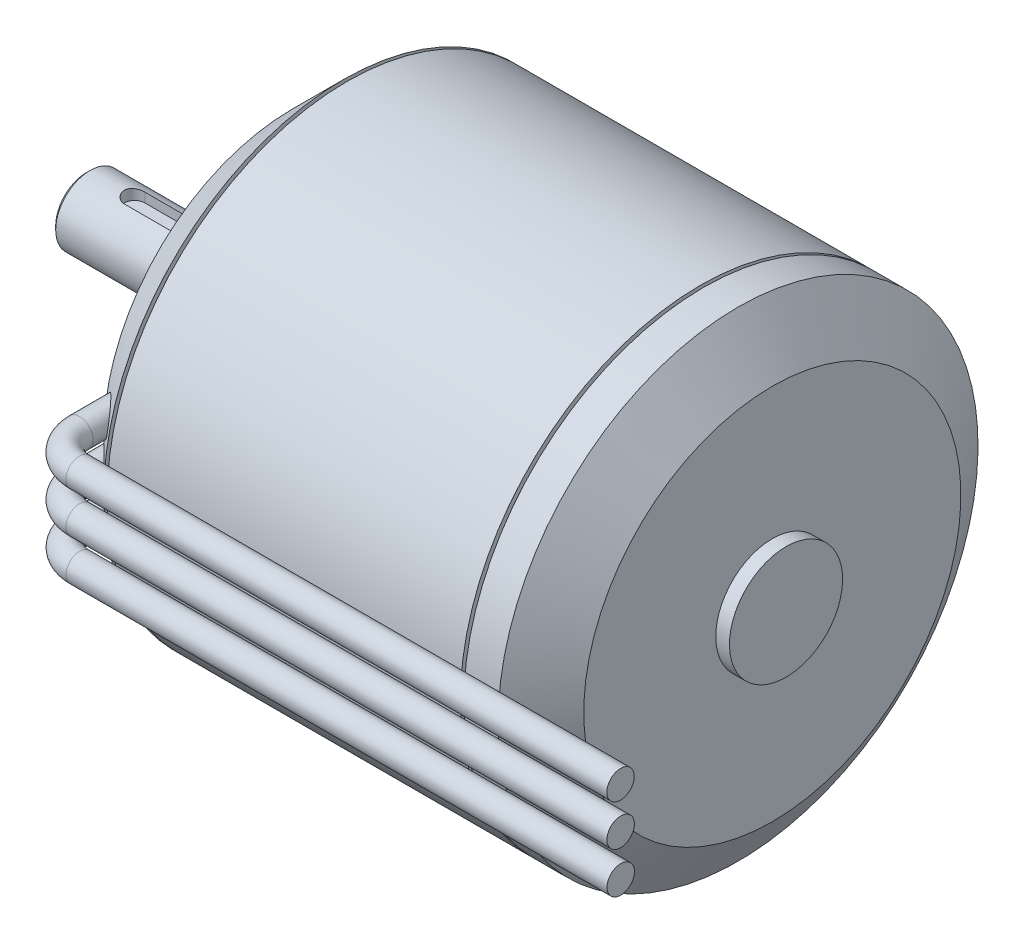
ISO-10303-21;
HEADER;
FILE_DESCRIPTION(('STEP AP214'),'2;1');
FILE_NAME('part.step','',(''),(''),'','','');
FILE_SCHEMA(('AUTOMOTIVE_DESIGN { 1 0 10303 214 1 1 1 1 }'));
ENDSEC;
DATA;
#1=APPLICATION_CONTEXT('core data for automotive mechanical design processes');
#2=APPLICATION_PROTOCOL_DEFINITION('international standard','automotive_design',2000,#1);
#3=PRODUCT_CONTEXT('',#1,'mechanical');
#4=PRODUCT('Part','Part','',(#3));
#5=PRODUCT_RELATED_PRODUCT_CATEGORY('part','',(#4));
#6=PRODUCT_DEFINITION_FORMATION('','',#4);
#7=PRODUCT_DEFINITION_CONTEXT('part definition',#1,'design');
#8=PRODUCT_DEFINITION('design','',#6,#7);
#9=PRODUCT_DEFINITION_SHAPE('','',#8);
#10=(LENGTH_UNIT() NAMED_UNIT(*) SI_UNIT(.MILLI.,.METRE.));
#11=(NAMED_UNIT(*) PLANE_ANGLE_UNIT() SI_UNIT($,.RADIAN.));
#12=(NAMED_UNIT(*) SI_UNIT($,.STERADIAN.) SOLID_ANGLE_UNIT());
#13=UNCERTAINTY_MEASURE_WITH_UNIT(LENGTH_MEASURE(1.E-05),#10,'distance_accuracy_value','');
#14=(GEOMETRIC_REPRESENTATION_CONTEXT(3) GLOBAL_UNCERTAINTY_ASSIGNED_CONTEXT((#13)) GLOBAL_UNIT_ASSIGNED_CONTEXT((#10,
#11,#12)) REPRESENTATION_CONTEXT('',''));
#15=CARTESIAN_POINT('',(0.,0.,0.));
#16=DIRECTION('',(0.,0.,1.));
#17=DIRECTION('',(1.,0.,0.));
#18=AXIS2_PLACEMENT_3D('',#15,#16,#17);
#19=CARTESIAN_POINT('',(15.7007527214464,5.99997934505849,39.8321532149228));
#20=DIRECTION('',(1.,0.,0.));
#21=DIRECTION('',(0.,0.,-1.));
#22=AXIS2_PLACEMENT_3D('',#19,#20,#21);
#23=PLANE('',#22);
#24=CARTESIAN_POINT('',(15.7007527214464,5.99997934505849,39.8321532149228));
#25=DIRECTION('',(1.,0.,0.));
#26=DIRECTION('',(0.,0.,-1.));
#27=AXIS2_PLACEMENT_3D('',#24,#25,#26);
#28=CIRCLE('',#27,2.);
#29=CARTESIAN_POINT('',(15.7007527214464,5.99997934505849,37.8321532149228));
#30=VERTEX_POINT('',#29);
#31=EDGE_CURVE('E327',#30,#30,#28,.T.);
#32=ORIENTED_EDGE('',*,*,#31,.T.);
#33=EDGE_LOOP('',(#32));
#34=FACE_BOUND('',#33,.T.);
#35=ADVANCED_FACE('F53',(#34),#23,.T.);
#36=CARTESIAN_POINT('',(-68.1993503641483,5.99997934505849,25.));
#37=DIRECTION('',(0.,0.,1.));
#38=DIRECTION('',(1.,0.,0.));
#39=AXIS2_PLACEMENT_3D('',#36,#37,#38);
#40=CYLINDRICAL_SURFACE('',#39,2.);
#41=CARTESIAN_POINT('',(-66.4863828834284,7.03232735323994,32.2559341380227));
#42=CARTESIAN_POINT('',(-66.5575557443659,7.15043774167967,32.1573398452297));
#43=CARTESIAN_POINT('',(-66.6380767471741,7.25652516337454,32.0509366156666));
#44=CARTESIAN_POINT('',(-66.8121150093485,7.44644952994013,31.8286367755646));
#45=CARTESIAN_POINT('',(-66.9056970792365,7.53016904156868,31.7126940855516));
#46=CARTESIAN_POINT('',(-67.0690543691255,7.65195549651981,31.5153628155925));
#47=CARTESIAN_POINT('',(-67.1362904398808,7.69591734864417,31.4354238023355));
#48=CARTESIAN_POINT('',(-67.2741256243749,7.77488044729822,31.273975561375));
#49=CARTESIAN_POINT('',(-67.3447259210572,7.80987851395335,31.1924657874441));
#50=CARTESIAN_POINT('',(-67.4886848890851,7.87109463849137,31.0285776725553));
#51=CARTESIAN_POINT('',(-67.562044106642,7.89731094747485,30.9461991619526));
#52=CARTESIAN_POINT('',(-67.7110315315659,7.94100261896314,30.7811749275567));
#53=CARTESIAN_POINT('',(-67.786659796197,7.95847776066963,30.6985291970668));
#54=CARTESIAN_POINT('',(-67.940862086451,7.9847689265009,30.5323402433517));
#55=CARTESIAN_POINT('',(-68.0194629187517,7.99345579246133,30.4488013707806));
#56=CARTESIAN_POINT('',(-68.1781267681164,8.00144399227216,30.2826231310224));
#57=CARTESIAN_POINT('',(-68.2581900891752,8.00074335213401,30.1999839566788));
#58=CARTESIAN_POINT('',(-68.4191379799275,7.98949939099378,30.0364466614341));
#59=CARTESIAN_POINT('',(-68.5000208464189,7.97897348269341,29.9555457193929));
#60=CARTESIAN_POINT('',(-68.6620998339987,7.94745817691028,29.796208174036));
#61=CARTESIAN_POINT('',(-68.7432957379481,7.92647506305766,29.7177701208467));
#62=CARTESIAN_POINT('',(-68.9245260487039,7.86686543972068,29.5461016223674));
#63=CARTESIAN_POINT('',(-69.0244617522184,7.82523497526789,29.4537742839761));
#64=CARTESIAN_POINT('',(-69.2214725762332,7.72264255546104,29.277137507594));
#65=CARTESIAN_POINT('',(-69.3185517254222,7.66170940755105,29.1928163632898));
#66=CARTESIAN_POINT('',(-69.4844692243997,7.53512369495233,29.0543526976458));
#67=CARTESIAN_POINT('',(-69.554611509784,7.47389011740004,28.9977594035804));
#68=CARTESIAN_POINT('',(-69.6887955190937,7.33812229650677,28.8939903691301));
#69=CARTESIAN_POINT('',(-69.7528453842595,7.26360619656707,28.8468019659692));
#70=CARTESIAN_POINT('',(-69.8602420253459,7.11712824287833,28.7726396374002));
#71=CARTESIAN_POINT('',(-69.9051996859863,7.04744264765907,28.7435225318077));
#72=CARTESIAN_POINT('',(-69.9871587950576,6.90042659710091,28.6948812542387));
#73=CARTESIAN_POINT('',(-70.0241655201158,6.82310126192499,28.6753507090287));
#74=CARTESIAN_POINT('',(-70.0885503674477,6.66214916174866,28.6470729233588));
#75=CARTESIAN_POINT('',(-70.1158770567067,6.57849152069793,28.6383826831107));
#76=CARTESIAN_POINT('',(-70.1592803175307,6.40791730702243,28.632555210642));
#77=CARTESIAN_POINT('',(-70.1753585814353,6.32100122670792,28.6354162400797));
#78=CARTESIAN_POINT('',(-70.1950060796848,6.15428643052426,28.6515926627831));
#79=CARTESIAN_POINT('',(-70.1995152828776,6.07450517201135,28.6640067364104));
#80=CARTESIAN_POINT('',(-70.1991760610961,5.91678887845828,28.6973238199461));
#81=CARTESIAN_POINT('',(-70.1943261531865,5.83885413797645,28.7182281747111));
#82=CARTESIAN_POINT('',(-70.1755064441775,5.68137779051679,28.7689948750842));
#83=CARTESIAN_POINT('',(-70.1609558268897,5.60206964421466,28.7993574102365));
#84=CARTESIAN_POINT('',(-70.1234608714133,5.44856749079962,28.8669511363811));
#85=CARTESIAN_POINT('',(-70.1005115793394,5.37437653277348,28.9041863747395));
#86=CARTESIAN_POINT('',(-70.0332939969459,5.19357450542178,29.0056483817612));
#87=CARTESIAN_POINT('',(-69.9841895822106,5.09086671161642,29.0736544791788));
#88=CARTESIAN_POINT('',(-69.8732591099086,4.89984765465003,29.2189436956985));
#89=CARTESIAN_POINT('',(-69.8114019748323,4.81157252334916,29.2962492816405));
#90=CARTESIAN_POINT('',(-69.6539735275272,4.6199326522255,29.4865660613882));
#91=CARTESIAN_POINT('',(-69.5543101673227,4.52270190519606,29.6023604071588));
#92=CARTESIAN_POINT('',(-69.3430864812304,4.35371412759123,29.84116041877));
#93=CARTESIAN_POINT('',(-69.2315182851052,4.28197408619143,29.9641708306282));
#94=CARTESIAN_POINT('',(-68.997529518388,4.1613233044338,30.2173825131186));
#95=CARTESIAN_POINT('',(-68.8749081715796,4.11302412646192,30.3476865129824));
#96=CARTESIAN_POINT('',(-68.6242806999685,4.04129731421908,30.6101416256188));
#97=CARTESIAN_POINT('',(-68.4962706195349,4.01788829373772,30.7422940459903));
#98=CARTESIAN_POINT('',(-68.2887994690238,4.00044269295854,30.9537677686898));
#99=CARTESIAN_POINT('',(-68.2101551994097,3.99845207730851,31.0333177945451));
#100=CARTESIAN_POINT('',(-68.0523822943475,4.00382483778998,31.1916994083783));
#101=CARTESIAN_POINT('',(-67.9732535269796,4.01119088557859,31.2705307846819));
#102=CARTESIAN_POINT('',(-67.8151836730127,4.03559459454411,31.4267651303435));
#103=CARTESIAN_POINT('',(-67.736242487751,4.05262464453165,31.5041691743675));
#104=CARTESIAN_POINT('',(-67.5791887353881,4.09681107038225,31.6568235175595));
#105=CARTESIAN_POINT('',(-67.501075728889,4.12396176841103,31.7320749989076));
#106=CARTESIAN_POINT('',(-67.3247374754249,4.19814660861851,31.9002188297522));
#107=CARTESIAN_POINT('',(-67.2270040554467,4.24861934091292,31.992151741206));
#108=CARTESIAN_POINT('',(-67.0365243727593,4.36887880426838,32.1681901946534));
#109=CARTESIAN_POINT('',(-66.9437698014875,4.43863208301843,32.252308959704));
#110=CARTESIAN_POINT('',(-66.7892847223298,4.57883484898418,32.3886980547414));
#111=CARTESIAN_POINT('',(-66.7256649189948,4.64459236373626,32.4436263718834));
#112=CARTESIAN_POINT('',(-66.6053565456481,4.78839456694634,32.5443225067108));
#113=CARTESIAN_POINT('',(-66.5486584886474,4.86642209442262,32.5901029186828));
#114=CARTESIAN_POINT('',(-66.4557356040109,5.0171497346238,32.6612209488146));
#115=CARTESIAN_POINT('',(-66.4176977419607,5.0876510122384,32.688826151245));
#116=CARTESIAN_POINT('',(-66.3495319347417,5.23528113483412,32.7345407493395));
#117=CARTESIAN_POINT('',(-66.3193980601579,5.31240495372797,32.7526572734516));
#118=CARTESIAN_POINT('',(-66.2684785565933,5.47197989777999,32.7780010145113));
#119=CARTESIAN_POINT('',(-66.2477516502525,5.55446090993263,32.7851604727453));
#120=CARTESIAN_POINT('',(-66.2170058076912,5.72155693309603,32.787622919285));
#121=CARTESIAN_POINT('',(-66.2069831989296,5.8061712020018,32.7829299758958));
#122=CARTESIAN_POINT('',(-66.1981782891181,5.96639567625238,32.7630786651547));
#123=CARTESIAN_POINT('',(-66.1984073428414,6.04208895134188,32.7489706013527));
#124=CARTESIAN_POINT('',(-66.2070882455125,6.19092063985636,32.7123270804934));
#125=CARTESIAN_POINT('',(-66.2155460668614,6.26405715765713,32.6897855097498));
#126=CARTESIAN_POINT('',(-66.2438554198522,6.43053646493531,32.6286588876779));
#127=CARTESIAN_POINT('',(-66.2665948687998,6.52233757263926,32.587225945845));
#128=CARTESIAN_POINT('',(-66.3225772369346,6.69724880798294,32.4945733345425));
#129=CARTESIAN_POINT('',(-66.3558255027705,6.78035448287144,32.4433486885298));
#130=CARTESIAN_POINT('',(-66.421943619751,6.91938547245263,32.3463217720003));
#131=CARTESIAN_POINT('',(-66.4531438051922,6.97716755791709,32.3019795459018));
#132=CARTESIAN_POINT('',(-66.4863828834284,7.03232735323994,32.2559341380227));
#133=B_SPLINE_CURVE_WITH_KNOTS('',3,(#41,#42,#43,#44,#45,#46,#47,#48,#49,#50,#51,#52,#53,#54,
#55,#56,#57,#58,#59,#60,#61,#62,#63,#64,#65,#66,#67,#68,#69,#70,#71,#72,#73,#74,#75,#76,#77,#78,
#79,#80,#81,#82,#83,#84,#85,#86,#87,#88,#89,#90,#91,#92,#93,#94,#95,#96,#97,#98,#99,#100,#101,
#102,#103,#104,#105,#106,#107,#108,#109,#110,#111,#112,#113,#114,#115,#116,#117,#118,#119,#120,
#121,#122,#123,#124,#125,#126,#127,#128,#129,#130,#131,#132),.UNSPECIFIED.,.T.,.F.,(4,2,2,2,2,2,
2,2,2,2,2,2,2,2,2,2,2,2,2,2,2,2,2,2,2,2,2,2,2,2,2,2,2,2,2,2,2,2,2,2,2,2,2,2,2,4),(0.,
0.50828475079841,1.01918781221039,1.35877825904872,1.69848900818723,2.03826737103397,
2.37805431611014,2.72276545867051,3.06754908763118,3.41172283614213,3.75569002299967,
4.18122529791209,4.60612846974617,4.93188348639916,5.2571968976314,5.51980458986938,
5.78223746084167,6.04604451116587,6.30981186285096,6.55135122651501,6.79292886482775,
7.05045146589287,7.30812620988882,7.70372674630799,8.10030297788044,8.64067110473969,
9.18139870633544,9.73556242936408,10.2901402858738,10.6254397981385,10.9608350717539,
11.2959665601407,11.6309103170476,12.0596269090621,12.4876042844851,12.8066986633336,
13.1253506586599,13.378537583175,13.6315340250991,13.8860887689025,14.1405561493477,
14.3705415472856,14.6006939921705,14.9087637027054,15.2169904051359,15.4543690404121),.UNSPECIFIED.);
#134=CARTESIAN_POINT('',(-66.4863828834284,7.03232735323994,32.2559341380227));
#135=VERTEX_POINT('',#134);
#136=EDGE_CURVE('E11',#135,#135,#133,.T.);
#137=ORIENTED_EDGE('',*,*,#136,.T.);
#138=EDGE_LOOP('',(#137));
#139=FACE_BOUND('',#138,.T.);
#140=CARTESIAN_POINT('',(-68.1993503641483,5.99997934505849,34.8321532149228));
#141=DIRECTION('',(0.,0.,1.));
#142=DIRECTION('',(1.,0.,0.));
#143=AXIS2_PLACEMENT_3D('',#140,#141,#142);
#144=CIRCLE('',#143,2.);
#145=CARTESIAN_POINT('',(-70.1993503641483,5.99997934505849,34.8321532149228));
#146=VERTEX_POINT('',#145);
#147=EDGE_CURVE('E65',#146,#146,#144,.T.);
#148=ORIENTED_EDGE('',*,*,#147,.F.);
#149=EDGE_LOOP('',(#148));
#150=FACE_BOUND('',#149,.T.);
#151=ADVANCED_FACE('F316',(#139,#150),#40,.T.);
#152=CARTESIAN_POINT('',(-63.1993503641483,5.99997934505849,34.8321532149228));
#153=DIRECTION('',(0.,1.,0.));
#154=DIRECTION('',(0.,0.,1.));
#155=AXIS2_PLACEMENT_3D('',#152,#153,#154);
#156=TOROIDAL_SURFACE('',#155,5.,2.);
#157=CARTESIAN_POINT('',(-63.1993503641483,5.99997934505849,39.8321532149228));
#158=DIRECTION('',(1.,0.,0.));
#159=DIRECTION('',(0.,0.,-1.));
#160=AXIS2_PLACEMENT_3D('',#157,#158,#159);
#161=CIRCLE('',#160,2.);
#162=CARTESIAN_POINT('',(-63.1993503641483,5.99997934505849,41.8321532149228));
#163=VERTEX_POINT('',#162);
#164=EDGE_CURVE('E330',#163,#163,#161,.T.);
#165=CARTESIAN_POINT('',(-63.1993503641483,5.99997934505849,34.8321532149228));
#166=DIRECTION('',(0.,1.,0.));
#167=DIRECTION('',(0.,0.,1.));
#168=AXIS2_PLACEMENT_3D('',#165,#166,#167);
#169=CIRCLE('',#168,7.);
#170=EDGE_CURVE('',#146,#163,#169,.T.);
#171=ORIENTED_EDGE('',*,*,#147,.T.);
#172=ORIENTED_EDGE('',*,*,#164,.F.);
#173=ORIENTED_EDGE('',*,*,#170,.T.);
#174=ORIENTED_EDGE('',*,*,#170,.F.);
#175=EDGE_LOOP('',(#171,#173,#172,#174));
#176=FACE_BOUND('',#175,.T.);
#177=ADVANCED_FACE('F323',(#176),#156,.T.);
#178=CARTESIAN_POINT('',(-63.1993503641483,5.99997934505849,39.8321532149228));
#179=DIRECTION('',(1.,0.,0.));
#180=DIRECTION('',(0.,0.,-1.));
#181=AXIS2_PLACEMENT_3D('',#178,#179,#180);
#182=CYLINDRICAL_SURFACE('',#181,2.);
#183=ORIENTED_EDGE('',*,*,#31,.F.);
#184=EDGE_LOOP('',(#183));
#185=FACE_BOUND('',#184,.T.);
#186=ORIENTED_EDGE('',*,*,#164,.T.);
#187=EDGE_LOOP('',(#186));
#188=FACE_BOUND('',#187,.T.);
#189=ADVANCED_FACE('F358',(#185,#188),#182,.T.);
#190=CARTESIAN_POINT('',(15.7322397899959,-5.9999793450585,39.8321532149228));
#191=DIRECTION('',(1.,0.,0.));
#192=DIRECTION('',(0.,0.,-1.));
#193=AXIS2_PLACEMENT_3D('',#190,#191,#192);
#194=PLANE('',#193);
#195=CARTESIAN_POINT('',(15.7322397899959,-5.9999793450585,39.8321532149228));
#196=DIRECTION('',(1.,0.,0.));
#197=DIRECTION('',(0.,0.,-1.));
#198=AXIS2_PLACEMENT_3D('',#195,#196,#197);
#199=CIRCLE('',#198,2.);
#200=CARTESIAN_POINT('',(15.7322397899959,-5.9999793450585,37.8321532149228));
#201=VERTEX_POINT('',#200);
#202=EDGE_CURVE('E285',#201,#201,#199,.T.);
#203=ORIENTED_EDGE('',*,*,#202,.T.);
#204=EDGE_LOOP('',(#203));
#205=FACE_BOUND('',#204,.T.);
#206=ADVANCED_FACE('F353',(#205),#194,.T.);
#207=CARTESIAN_POINT('',(-68.1678632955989,-5.99997934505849,25.));
#208=DIRECTION('',(0.,0.,1.));
#209=DIRECTION('',(1.,0.,0.));
#210=AXIS2_PLACEMENT_3D('',#207,#208,#209);
#211=CYLINDRICAL_SURFACE('',#210,2.);
#212=CARTESIAN_POINT('',(-66.6026862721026,-4.75490067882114,32.5518689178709));
#213=CARTESIAN_POINT('',(-66.6798191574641,-4.65793986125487,32.4880814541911));
#214=CARTESIAN_POINT('',(-66.7634052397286,-4.57137825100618,32.4159125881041));
#215=CARTESIAN_POINT('',(-66.9384920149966,-4.41810803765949,32.2604459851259));
#216=CARTESIAN_POINT('',(-67.0300334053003,-4.35151033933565,32.1770896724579));
#217=CARTESIAN_POINT('',(-67.2477963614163,-4.21824388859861,31.9752202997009));
#218=CARTESIAN_POINT('',(-67.375708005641,-4.15843186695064,31.8540184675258));
#219=CARTESIAN_POINT('',(-67.6345150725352,-4.06753153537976,31.6048270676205));
#220=CARTESIAN_POINT('',(-67.7654094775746,-4.03643357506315,31.4768397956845));
#221=CARTESIAN_POINT('',(-68.0307730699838,-4.00007915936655,31.2139649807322));
#222=CARTESIAN_POINT('',(-68.1652447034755,-3.99553231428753,31.0789844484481));
#223=CARTESIAN_POINT('',(-68.431739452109,-4.01296743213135,30.8080119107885));
#224=CARTESIAN_POINT('',(-68.563759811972,-4.03497760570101,30.6720189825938));
#225=CARTESIAN_POINT('',(-68.769975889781,-4.09110287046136,30.4564970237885));
#226=CARTESIAN_POINT('',(-68.8459525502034,-4.11671537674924,30.3763882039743));
#227=CARTESIAN_POINT('',(-68.9953061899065,-4.17738673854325,30.2173367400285));
#228=CARTESIAN_POINT('',(-69.0686823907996,-4.21244839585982,30.138394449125));
#229=CARTESIAN_POINT('',(-69.283565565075,-4.33203401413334,29.904459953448));
#230=CARTESIAN_POINT('',(-69.4202761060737,-4.43107609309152,29.7518928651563));
#231=CARTESIAN_POINT('',(-69.623593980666,-4.62434583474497,29.5164782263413));
#232=CARTESIAN_POINT('',(-69.6970921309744,-4.70608588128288,29.4291780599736));
#233=CARTESIAN_POINT('',(-69.8325367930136,-4.88576400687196,29.2625713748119));
#234=CARTESIAN_POINT('',(-69.8945020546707,-4.98367529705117,29.1832519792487));
#235=CARTESIAN_POINT('',(-69.9905494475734,-5.17155612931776,29.0528976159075));
#236=CARTESIAN_POINT('',(-70.0277681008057,-5.25829245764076,28.9995273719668));
#237=CARTESIAN_POINT('',(-70.0905077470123,-5.44077377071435,28.9020047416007));
#238=CARTESIAN_POINT('',(-70.11604309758,-5.5365075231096,28.8578410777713));
#239=CARTESIAN_POINT('',(-70.1494215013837,-5.71678462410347,28.7885763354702));
#240=CARTESIAN_POINT('',(-70.1596708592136,-5.80010048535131,28.7614578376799));
#241=CARTESIAN_POINT('',(-70.1694391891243,-5.96988301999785,28.7167190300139));
#242=CARTESIAN_POINT('',(-70.1689651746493,-6.05634759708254,28.6990925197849));
#243=CARTESIAN_POINT('',(-70.1564609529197,-6.23048694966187,28.6745888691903));
#244=CARTESIAN_POINT('',(-70.1443691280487,-6.31816572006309,28.6677695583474));
#245=CARTESIAN_POINT('',(-70.108596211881,-6.49126229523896,28.6657514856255));
#246=CARTESIAN_POINT('',(-70.0849177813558,-6.57668061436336,28.6705500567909));
#247=CARTESIAN_POINT('',(-70.0295768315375,-6.73513470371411,28.6905723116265));
#248=CARTESIAN_POINT('',(-69.998788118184,-6.80860123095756,28.7048527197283));
#249=CARTESIAN_POINT('',(-69.9297924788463,-6.94959524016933,28.7420324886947));
#250=CARTESIAN_POINT('',(-69.8915842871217,-7.01712170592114,28.7649333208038));
#251=CARTESIAN_POINT('',(-69.8066996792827,-7.14922360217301,28.8198580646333));
#252=CARTESIAN_POINT('',(-69.7596436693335,-7.21335210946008,28.8523620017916));
#253=CARTESIAN_POINT('',(-69.6605961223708,-7.33332571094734,28.924294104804));
#254=CARTESIAN_POINT('',(-69.6086018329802,-7.38916614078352,28.9637261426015));
#255=CARTESIAN_POINT('',(-69.4700614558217,-7.52251928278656,29.0725453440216));
#256=CARTESIAN_POINT('',(-69.3808938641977,-7.59393848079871,29.146085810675));
#257=CARTESIAN_POINT('',(-69.1979172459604,-7.71790367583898,29.3027598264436));
#258=CARTESIAN_POINT('',(-69.1040961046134,-7.77039711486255,29.3859192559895));
#259=CARTESIAN_POINT('',(-68.8752748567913,-7.8765205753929,29.5945119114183));
#260=CARTESIAN_POINT('',(-68.7393007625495,-7.92163147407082,29.7231980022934));
#261=CARTESIAN_POINT('',(-68.4680822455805,-7.98219902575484,29.9877364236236));
#262=CARTESIAN_POINT('',(-68.3328382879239,-7.99763859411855,30.1235928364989));
#263=CARTESIAN_POINT('',(-68.061603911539,-8.0018911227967,30.4030204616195));
#264=CARTESIAN_POINT('',(-67.9257162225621,-7.9898787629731,30.5467006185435));
#265=CARTESIAN_POINT('',(-67.6594740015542,-7.93903592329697,30.83495605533));
#266=CARTESIAN_POINT('',(-67.5291293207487,-7.90015965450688,30.9795324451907));
#267=CARTESIAN_POINT('',(-67.3270716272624,-7.8165154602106,31.2090057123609));
#268=CARTESIAN_POINT('',(-67.2526869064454,-7.78026409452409,31.2947332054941));
#269=CARTESIAN_POINT('',(-67.1075242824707,-7.69781749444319,31.4645791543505));
#270=CARTESIAN_POINT('',(-67.0367480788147,-7.65161762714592,31.5486968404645));
#271=CARTESIAN_POINT('',(-66.8999239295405,-7.54904991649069,31.7140596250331));
#272=CARTESIAN_POINT('',(-66.8338623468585,-7.49271320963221,31.7953126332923));
#273=CARTESIAN_POINT('',(-66.7074527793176,-7.3692840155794,31.9538870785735));
#274=CARTESIAN_POINT('',(-66.6470983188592,-7.3022039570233,32.0312129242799));
#275=CARTESIAN_POINT('',(-66.534061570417,-7.15716713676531,32.1797386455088));
#276=CARTESIAN_POINT('',(-66.4813233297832,-7.07929890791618,32.2509814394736));
#277=CARTESIAN_POINT('',(-66.3852142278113,-6.91182213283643,32.3855669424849));
#278=CARTESIAN_POINT('',(-66.341830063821,-6.82223055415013,32.4489208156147));
#279=CARTESIAN_POINT('',(-66.2744654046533,-6.64953414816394,32.5534497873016));
#280=CARTESIAN_POINT('',(-66.2483635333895,-6.56843913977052,32.5965512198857));
#281=CARTESIAN_POINT('',(-66.2062119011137,-6.39933449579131,32.6731230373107));
#282=CARTESIAN_POINT('',(-66.1901497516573,-6.31133353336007,32.7066052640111));
#283=CARTESIAN_POINT('',(-66.1717090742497,-6.14535678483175,32.7569186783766));
#284=CARTESIAN_POINT('',(-66.1674985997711,-6.06814885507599,32.7755933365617));
#285=CARTESIAN_POINT('',(-66.168276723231,-5.91206466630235,32.8033158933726));
#286=CARTESIAN_POINT('',(-66.1732589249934,-5.83318960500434,32.8123704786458));
#287=CARTESIAN_POINT('',(-66.1926990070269,-5.67591593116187,32.8202132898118));
#288=CARTESIAN_POINT('',(-66.2071772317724,-5.59751870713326,32.8189794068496));
#289=CARTESIAN_POINT('',(-66.2451316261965,-5.44376031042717,32.8063613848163));
#290=CARTESIAN_POINT('',(-66.2686126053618,-5.36840078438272,32.7949718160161));
#291=CARTESIAN_POINT('',(-66.3226986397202,-5.22466154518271,32.7634065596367));
#292=CARTESIAN_POINT('',(-66.353098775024,-5.15614991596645,32.7434713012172));
#293=CARTESIAN_POINT('',(-66.4200307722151,-5.02504482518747,32.6961317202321));
#294=CARTESIAN_POINT('',(-66.4565590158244,-4.96244790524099,32.6687317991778));
#295=CARTESIAN_POINT('',(-66.5125024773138,-4.87715028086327,32.6249744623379));
#296=CARTESIAN_POINT('',(-66.5299721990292,-4.8518315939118,32.6110865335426));
#297=CARTESIAN_POINT('',(-66.5657311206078,-4.80243973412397,32.5822518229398));
#298=CARTESIAN_POINT('',(-66.5840197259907,-4.77836568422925,32.5673058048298));
#299=CARTESIAN_POINT('',(-66.6026862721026,-4.75490067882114,32.5518689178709));
#300=B_SPLINE_CURVE_WITH_KNOTS('',3,(#212,#213,#214,#215,#216,#217,#218,#219,#220,#221,#222,
#223,#224,#225,#226,#227,#228,#229,#230,#231,#232,#233,#234,#235,#236,#237,#238,#239,#240,#241,
#242,#243,#244,#245,#246,#247,#248,#249,#250,#251,#252,#253,#254,#255,#256,#257,#258,#259,#260,
#261,#262,#263,#264,#265,#266,#267,#268,#269,#270,#271,#272,#273,#274,#275,#276,#277,#278,#279,
#280,#281,#282,#283,#284,#285,#286,#287,#288,#289,#290,#291,#292,#293,#294,#295,#296,#297,#298,
#299),.UNSPECIFIED.,.T.,.F.,(4,2,2,2,2,2,2,2,2,2,2,2,2,2,2,2,2,2,2,2,2,2,2,2,2,2,2,2,2,2,2,2,2,
2,2,2,2,2,2,2,2,2,2,4),(0.,0.41792630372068,0.838133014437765,1.3933957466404,1.94847179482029,
2.51831735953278,3.08876878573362,3.42838039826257,3.76809282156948,4.44556717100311,
4.86545306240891,5.28465023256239,5.60879627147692,5.93254289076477,6.1961137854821,
6.45951230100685,6.72431556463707,6.98905804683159,7.23076862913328,7.47252048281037,
7.72935439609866,7.98633230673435,8.39163166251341,8.79804804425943,9.37264880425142,
9.94758031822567,10.5400231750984,11.1334783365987,11.4905205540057,11.8477294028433,
12.2038592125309,12.5595799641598,12.9125376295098,13.2649899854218,13.5503735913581,
13.8354043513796,14.0730150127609,14.3104604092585,14.5484161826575,14.7864992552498,
15.018283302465,15.2499309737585,15.3511435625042,15.4522838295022),.UNSPECIFIED.);
#301=CARTESIAN_POINT('',(-66.6026862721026,-4.75490067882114,32.5518689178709));
#302=VERTEX_POINT('',#301);
#303=EDGE_CURVE('E331',#302,#302,#300,.T.);
#304=ORIENTED_EDGE('',*,*,#303,.T.);
#305=EDGE_LOOP('',(#304));
#306=FACE_BOUND('',#305,.T.);
#307=CARTESIAN_POINT('',(-68.1678632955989,-5.99997934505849,34.8321532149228));
#308=DIRECTION('',(0.,0.,1.));
#309=DIRECTION('',(1.,0.,0.));
#310=AXIS2_PLACEMENT_3D('',#307,#308,#309);
#311=CIRCLE('',#310,2.);
#312=CARTESIAN_POINT('',(-70.1678632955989,-5.99997934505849,34.8321532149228));
#313=VERTEX_POINT('',#312);
#314=EDGE_CURVE('E338',#313,#313,#311,.T.);
#315=ORIENTED_EDGE('',*,*,#314,.F.);
#316=EDGE_LOOP('',(#315));
#317=FACE_BOUND('',#316,.T.);
#318=ADVANCED_FACE('F347',(#306,#317),#211,.T.);
#319=CARTESIAN_POINT('',(-63.1678632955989,-5.9999793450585,34.8321532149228));
#320=DIRECTION('',(0.,1.,0.));
#321=DIRECTION('',(0.,0.,1.));
#322=AXIS2_PLACEMENT_3D('',#319,#320,#321);
#323=TOROIDAL_SURFACE('',#322,5.,2.);
#324=CARTESIAN_POINT('',(-63.1678632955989,-5.9999793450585,39.8321532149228));
#325=DIRECTION('',(1.,0.,0.));
#326=DIRECTION('',(0.,0.,-1.));
#327=AXIS2_PLACEMENT_3D('',#324,#325,#326);
#328=CIRCLE('',#327,2.);
#329=CARTESIAN_POINT('',(-63.1678632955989,-5.9999793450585,41.8321532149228));
#330=VERTEX_POINT('',#329);
#331=EDGE_CURVE('E774',#330,#330,#328,.T.);
#332=CARTESIAN_POINT('',(-63.1678632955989,-5.9999793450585,34.8321532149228));
#333=DIRECTION('',(0.,1.,0.));
#334=DIRECTION('',(0.,0.,1.));
#335=AXIS2_PLACEMENT_3D('',#332,#333,#334);
#336=CIRCLE('',#335,7.);
#337=EDGE_CURVE('',#313,#330,#336,.T.);
#338=ORIENTED_EDGE('',*,*,#314,.T.);
#339=ORIENTED_EDGE('',*,*,#331,.F.);
#340=ORIENTED_EDGE('',*,*,#337,.T.);
#341=ORIENTED_EDGE('',*,*,#337,.F.);
#342=EDGE_LOOP('',(#338,#340,#339,#341));
#343=FACE_BOUND('',#342,.T.);
#344=ADVANCED_FACE('F352',(#343),#323,.T.);
#345=CARTESIAN_POINT('',(-63.1678632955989,-5.9999793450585,39.8321532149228));
#346=DIRECTION('',(1.,0.,0.));
#347=DIRECTION('',(0.,0.,-1.));
#348=AXIS2_PLACEMENT_3D('',#345,#346,#347);
#349=CYLINDRICAL_SURFACE('',#348,2.);
#350=ORIENTED_EDGE('',*,*,#202,.F.);
#351=EDGE_LOOP('',(#350));
#352=FACE_BOUND('',#351,.T.);
#353=ORIENTED_EDGE('',*,*,#331,.T.);
#354=EDGE_LOOP('',(#353));
#355=FACE_BOUND('',#354,.T.);
#356=ADVANCED_FACE('F388',(#352,#355),#349,.T.);
#357=CARTESIAN_POINT('',(0.,0.,0.));
#358=DIRECTION('',(1.,0.,0.));
#359=DIRECTION('',(0.,1.,0.));
#360=AXIS2_PLACEMENT_3D('',#357,#358,#359);
#361=CYLINDRICAL_SURFACE('',#360,5.);
#362=CARTESIAN_POINT('',(-101.5,0.,0.));
#363=DIRECTION('',(-1.,0.,0.));
#364=DIRECTION('',(0.,-1.,0.));
#365=AXIS2_PLACEMENT_3D('',#362,#363,#364);
#366=CIRCLE('',#365,5.);
#367=CARTESIAN_POINT('',(-101.5,-5.00000000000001,0.));
#368=VERTEX_POINT('',#367);
#369=EDGE_CURVE('E269',#368,#368,#366,.F.);
#370=ORIENTED_EDGE('',*,*,#369,.T.);
#371=EDGE_LOOP('',(#370));
#372=FACE_BOUND('',#371,.T.);
#373=CARTESIAN_POINT('',(-72.,0.,0.));
#374=DIRECTION('',(1.,0.,0.));
#375=DIRECTION('',(0.,1.,0.));
#376=AXIS2_PLACEMENT_3D('',#373,#374,#375);
#377=CIRCLE('',#376,5.);
#378=CARTESIAN_POINT('',(-72.,4.99999999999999,0.));
#379=VERTEX_POINT('',#378);
#380=EDGE_CURVE('E224',#379,#379,#377,.T.);
#381=ORIENTED_EDGE('',*,*,#380,.F.);
#382=EDGE_LOOP('',(#381));
#383=FACE_BOUND('',#382,.T.);
#384=DIRECTION('',(1.,0.,0.));
#385=VECTOR('',#384,1.);
#386=CARTESIAN_POINT('',(0.,4.76969600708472,1.5));
#387=LINE('',#386,#385);
#388=CARTESIAN_POINT('',(-78.,4.76969600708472,1.5));
#389=VERTEX_POINT('',#388);
#390=CARTESIAN_POINT('',(-95.,4.76969600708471,1.5));
#391=VERTEX_POINT('',#390);
#392=EDGE_CURVE('E242',#389,#391,#387,.F.);
#393=ORIENTED_EDGE('',*,*,#392,.T.);
#394=CARTESIAN_POINT('',(-95.,4.76969600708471,1.5));
#395=CARTESIAN_POINT('',(-95.041179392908,4.76969249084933,1.50000085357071));
#396=CARTESIAN_POINT('',(-95.0823380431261,4.77022997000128,1.49830317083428));
#397=CARTESIAN_POINT('',(-95.1643411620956,4.77235095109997,1.49153785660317));
#398=CARTESIAN_POINT('',(-95.2051856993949,4.77393421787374,1.48647098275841));
#399=CARTESIAN_POINT('',(-95.3265905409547,4.78018490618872,1.46630203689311));
#400=CARTESIAN_POINT('',(-95.4063063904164,4.78635370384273,1.44623120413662));
#401=CARTESIAN_POINT('',(-95.5610355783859,4.80195952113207,1.39353102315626));
#402=CARTESIAN_POINT('',(-95.6360505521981,4.81139539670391,1.36090607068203));
#403=CARTESIAN_POINT('',(-95.7795966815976,4.8324657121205,1.28407841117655));
#404=CARTESIAN_POINT('',(-95.8481247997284,4.84410117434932,1.23987031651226));
#405=CARTESIAN_POINT('',(-95.978866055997,4.86866835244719,1.13964850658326));
#406=CARTESIAN_POINT('',(-96.0408436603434,4.88162755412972,1.08333433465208));
#407=CARTESIAN_POINT('',(-96.1546355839,4.90714811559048,0.961138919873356));
#408=CARTESIAN_POINT('',(-96.2064481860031,4.91970940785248,0.895256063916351));
#409=CARTESIAN_POINT('',(-96.2994637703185,4.94333239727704,0.754109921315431));
#410=CARTESIAN_POINT('',(-96.340425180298,4.95435770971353,0.678680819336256));
#411=CARTESIAN_POINT('',(-96.4089884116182,4.97334469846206,0.521621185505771));
#412=CARTESIAN_POINT('',(-96.4365936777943,4.98130716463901,0.439992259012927));
#413=CARTESIAN_POINT('',(-96.4768797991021,4.99307639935,0.275324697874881));
#414=CARTESIAN_POINT('',(-96.4899648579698,4.99699549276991,0.192393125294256));
#415=CARTESIAN_POINT('',(-96.5021173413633,5.00063202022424,0.0254235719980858));
#416=CARTESIAN_POINT('',(-96.5011874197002,5.00035024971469,-0.0586141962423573));
#417=CARTESIAN_POINT('',(-96.485607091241,4.99569602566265,-0.222571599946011));
#418=CARTESIAN_POINT('',(-96.4713946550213,4.99145415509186,-0.302537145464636));
#419=CARTESIAN_POINT('',(-96.4303683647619,4.97951513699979,-0.458890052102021));
#420=CARTESIAN_POINT('',(-96.4035538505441,4.97181780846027,-0.535277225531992));
#421=CARTESIAN_POINT('',(-96.3377877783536,4.95365214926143,-0.68334781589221));
#422=CARTESIAN_POINT('',(-96.2986983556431,4.94315255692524,-0.754966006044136));
#423=CARTESIAN_POINT('',(-96.2096014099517,4.92049624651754,-0.890765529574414));
#424=CARTESIAN_POINT('',(-96.1595914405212,4.90833915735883,-0.954945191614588));
#425=CARTESIAN_POINT('',(-96.0478080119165,4.88311673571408,-1.07665450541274));
#426=CARTESIAN_POINT('',(-95.9856561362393,4.87003445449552,-1.13383351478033));
#427=CARTESIAN_POINT('',(-95.8525025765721,4.84484215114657,-1.23706769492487));
#428=CARTESIAN_POINT('',(-95.7814983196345,4.83273241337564,-1.28311962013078));
#429=CARTESIAN_POINT('',(-95.6317190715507,4.81077228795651,-1.36316407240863));
#430=CARTESIAN_POINT('',(-95.5528728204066,4.80094596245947,-1.39703006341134));
#431=CARTESIAN_POINT('',(-95.3902754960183,4.78495663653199,-1.45085886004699));
#432=CARTESIAN_POINT('',(-95.3065321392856,4.77878803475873,-1.47084293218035));
#433=CARTESIAN_POINT('',(-95.1850051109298,4.77314032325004,-1.4890120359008));
#434=CARTESIAN_POINT('',(-95.1481092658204,4.77185156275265,-1.49313202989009));
#435=CARTESIAN_POINT('',(-95.0741485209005,4.77012928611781,-1.49862355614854));
#436=CARTESIAN_POINT('',(-95.0370839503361,4.76969451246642,-1.49999912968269));
#437=CARTESIAN_POINT('',(-95.,4.76969600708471,-1.5));
#438=B_SPLINE_CURVE_WITH_KNOTS('',3,(#394,#395,#396,#397,#398,#399,#400,#401,#402,#403,#404,
#405,#406,#407,#408,#409,#410,#411,#412,#413,#414,#415,#416,#417,#418,#419,#420,#421,#422,#423,
#424,#425,#426,#427,#428,#429,#430,#431,#432,#433,#434,#435,#436,#437),.UNSPECIFIED.,.F.,.F.,(4,
2,2,2,2,2,2,2,2,2,2,2,2,2,2,2,2,2,2,2,2,4),(0.,0.123459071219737,0.24689038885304,
0.492911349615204,0.73884624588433,0.984895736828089,1.23795510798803,1.49105719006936,
1.74939356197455,2.00766326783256,2.25854751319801,2.5093842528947,2.75223130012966,
2.99509107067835,3.24078242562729,3.48652887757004,3.74172568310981,3.99699683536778,
4.25484698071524,4.51230123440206,4.62365084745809,4.73483637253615),.UNSPECIFIED.);
#439=CARTESIAN_POINT('',(-95.,4.76969600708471,-1.5));
#440=VERTEX_POINT('',#439);
#441=EDGE_CURVE('E80',#391,#440,#438,.T.);
#442=ORIENTED_EDGE('',*,*,#441,.T.);
#443=DIRECTION('',(1.,0.,0.));
#444=VECTOR('',#443,1.);
#445=CARTESIAN_POINT('',(0.,4.76969600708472,-1.5));
#446=LINE('',#445,#444);
#447=CARTESIAN_POINT('',(-78.,4.76969600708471,-1.5));
#448=VERTEX_POINT('',#447);
#449=EDGE_CURVE('E228',#440,#448,#446,.T.);
#450=ORIENTED_EDGE('',*,*,#449,.T.);
#451=CARTESIAN_POINT('',(-78.,4.76969600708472,-1.5));
#452=CARTESIAN_POINT('',(-77.958820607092,4.76969249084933,-1.50000085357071));
#453=CARTESIAN_POINT('',(-77.9176619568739,4.77022997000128,-1.49830317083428));
#454=CARTESIAN_POINT('',(-77.8356588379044,4.77235095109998,-1.49153785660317));
#455=CARTESIAN_POINT('',(-77.7948143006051,4.77393421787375,-1.48647098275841));
#456=CARTESIAN_POINT('',(-77.6734094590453,4.78018490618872,-1.46630203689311));
#457=CARTESIAN_POINT('',(-77.5936936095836,4.78635370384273,-1.44623120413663));
#458=CARTESIAN_POINT('',(-77.4389644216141,4.80195952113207,-1.39353102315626));
#459=CARTESIAN_POINT('',(-77.3639494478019,4.81139539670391,-1.36090607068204));
#460=CARTESIAN_POINT('',(-77.2204033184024,4.8324657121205,-1.28407841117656));
#461=CARTESIAN_POINT('',(-77.1518752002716,4.84410117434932,-1.23987031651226));
#462=CARTESIAN_POINT('',(-77.021133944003,4.8686683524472,-1.13964850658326));
#463=CARTESIAN_POINT('',(-76.9591563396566,4.88162755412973,-1.08333433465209));
#464=CARTESIAN_POINT('',(-76.8453644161,4.90714811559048,-0.961138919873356));
#465=CARTESIAN_POINT('',(-76.7935518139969,4.91970940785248,-0.895256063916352));
#466=CARTESIAN_POINT('',(-76.7005362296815,4.94333239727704,-0.754109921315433));
#467=CARTESIAN_POINT('',(-76.659574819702,4.95435770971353,-0.67868081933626));
#468=CARTESIAN_POINT('',(-76.5910115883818,4.97334469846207,-0.521621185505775));
#469=CARTESIAN_POINT('',(-76.5634063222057,4.98130716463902,-0.43999225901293));
#470=CARTESIAN_POINT('',(-76.5231202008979,4.99307639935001,-0.275324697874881));
#471=CARTESIAN_POINT('',(-76.5100351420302,4.99699549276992,-0.192393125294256));
#472=CARTESIAN_POINT('',(-76.4978826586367,5.00063202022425,-0.0254235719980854));
#473=CARTESIAN_POINT('',(-76.4988125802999,5.0003502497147,0.0586141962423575));
#474=CARTESIAN_POINT('',(-76.514392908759,4.99569602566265,0.22257159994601));
#475=CARTESIAN_POINT('',(-76.5286053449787,4.99145415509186,0.302537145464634));
#476=CARTESIAN_POINT('',(-76.5696316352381,4.97951513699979,0.458890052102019));
#477=CARTESIAN_POINT('',(-76.5964461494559,4.97181780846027,0.535277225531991));
#478=CARTESIAN_POINT('',(-76.6622122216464,4.95365214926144,0.68334781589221));
#479=CARTESIAN_POINT('',(-76.7013016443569,4.94315255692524,0.754966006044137));
#480=CARTESIAN_POINT('',(-76.7903985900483,4.92049624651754,0.890765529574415));
#481=CARTESIAN_POINT('',(-76.8404085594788,4.90833915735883,0.954945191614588));
#482=CARTESIAN_POINT('',(-76.9521919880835,4.88311673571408,1.07665450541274));
#483=CARTESIAN_POINT('',(-77.0143438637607,4.87003445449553,1.13383351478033));
#484=CARTESIAN_POINT('',(-77.1474974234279,4.84484215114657,1.23706769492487));
#485=CARTESIAN_POINT('',(-77.2185016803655,4.83273241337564,1.28311962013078));
#486=CARTESIAN_POINT('',(-77.3682809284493,4.81077228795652,1.36316407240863));
#487=CARTESIAN_POINT('',(-77.4471271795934,4.80094596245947,1.39703006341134));
#488=CARTESIAN_POINT('',(-77.6097245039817,4.784956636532,1.45085886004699));
#489=CARTESIAN_POINT('',(-77.6934678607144,4.77878803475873,1.47084293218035));
#490=CARTESIAN_POINT('',(-77.8149948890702,4.77314032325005,1.48901203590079));
#491=CARTESIAN_POINT('',(-77.8518907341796,4.77185156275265,1.49313202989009));
#492=CARTESIAN_POINT('',(-77.9258514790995,4.77012928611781,1.49862355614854));
#493=CARTESIAN_POINT('',(-77.9629160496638,4.76969451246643,1.49999912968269));
#494=CARTESIAN_POINT('',(-78.,4.76969600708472,1.5));
#495=B_SPLINE_CURVE_WITH_KNOTS('',3,(#451,#452,#453,#454,#455,#456,#457,#458,#459,#460,#461,
#462,#463,#464,#465,#466,#467,#468,#469,#470,#471,#472,#473,#474,#475,#476,#477,#478,#479,#480,
#481,#482,#483,#484,#485,#486,#487,#488,#489,#490,#491,#492,#493,#494),.UNSPECIFIED.,.F.,.F.,(4,
2,2,2,2,2,2,2,2,2,2,2,2,2,2,2,2,2,2,2,2,4),(0.,0.123459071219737,0.24689038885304,
0.492911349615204,0.738846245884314,0.984895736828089,1.23795510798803,1.49105719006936,
1.74939356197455,2.00766326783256,2.25854751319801,2.5093842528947,2.75223130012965,
2.99509107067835,3.2407824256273,3.48652887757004,3.74172568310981,3.99699683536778,
4.25484698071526,4.51230123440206,4.62365084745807,4.73483637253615),.UNSPECIFIED.);
#496=EDGE_CURVE('E232',#448,#389,#495,.T.);
#497=ORIENTED_EDGE('',*,*,#496,.T.);
#498=EDGE_LOOP('',(#393,#442,#450,#497));
#499=FACE_BOUND('',#498,.T.);
#500=ADVANCED_FACE('F244',(#372,#383,#499),#361,.T.);
#501=CARTESIAN_POINT('',(-102.,0.,0.));
#502=DIRECTION('',(-1.,0.,0.));
#503=DIRECTION('',(0.,-1.,0.));
#504=AXIS2_PLACEMENT_3D('',#501,#502,#503);
#505=PLANE('',#504);
#506=CARTESIAN_POINT('',(-102.,0.,0.));
#507=DIRECTION('',(-1.,0.,0.));
#508=DIRECTION('',(0.,-1.,0.));
#509=AXIS2_PLACEMENT_3D('',#506,#507,#508);
#510=CIRCLE('',#509,4.50000000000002);
#511=CARTESIAN_POINT('',(-102.,-4.50000000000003,0.));
#512=VERTEX_POINT('',#511);
#513=EDGE_CURVE('E273',#512,#512,#510,.T.);
#514=ORIENTED_EDGE('',*,*,#513,.T.);
#515=EDGE_LOOP('',(#514));
#516=FACE_BOUND('',#515,.T.);
#517=ADVANCED_FACE('F401',(#516),#505,.T.);
#518=CARTESIAN_POINT('',(-72.,4.99999999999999,0.));
#519=DIRECTION('',(-1.,0.,0.));
#520=DIRECTION('',(0.,-1.,0.));
#521=AXIS2_PLACEMENT_3D('',#518,#519,#520);
#522=PLANE('',#521);
#523=CARTESIAN_POINT('',(-72.,0.,-22.));
#524=DIRECTION('',(-1.,0.,0.));
#525=DIRECTION('',(0.,-1.,0.));
#526=AXIS2_PLACEMENT_3D('',#523,#524,#525);
#527=CIRCLE('',#526,2.);
#528=CARTESIAN_POINT('',(-72.,-2.00000000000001,-22.));
#529=VERTEX_POINT('',#528);
#530=EDGE_CURVE('E141',#529,#529,#527,.T.);
#531=ORIENTED_EDGE('',*,*,#530,.F.);
#532=EDGE_LOOP('',(#531));
#533=FACE_BOUND('',#532,.T.);
#534=CARTESIAN_POINT('',(-72.,0.,22.));
#535=DIRECTION('',(-1.,0.,0.));
#536=DIRECTION('',(0.,-1.,0.));
#537=AXIS2_PLACEMENT_3D('',#534,#535,#536);
#538=CIRCLE('',#537,2.);
#539=CARTESIAN_POINT('',(-72.,-2.00000000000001,22.));
#540=VERTEX_POINT('',#539);
#541=EDGE_CURVE('E146',#540,#540,#538,.T.);
#542=ORIENTED_EDGE('',*,*,#541,.F.);
#543=EDGE_LOOP('',(#542));
#544=FACE_BOUND('',#543,.T.);
#545=CARTESIAN_POINT('',(-72.,22.,0.));
#546=DIRECTION('',(-1.,0.,0.));
#547=DIRECTION('',(0.,-1.,0.));
#548=AXIS2_PLACEMENT_3D('',#545,#546,#547);
#549=CIRCLE('',#548,2.);
#550=CARTESIAN_POINT('',(-72.,20.,0.));
#551=VERTEX_POINT('',#550);
#552=EDGE_CURVE('E150',#551,#551,#549,.T.);
#553=ORIENTED_EDGE('',*,*,#552,.F.);
#554=EDGE_LOOP('',(#553));
#555=FACE_BOUND('',#554,.T.);
#556=CARTESIAN_POINT('',(-72.,-22.,0.));
#557=DIRECTION('',(-1.,0.,0.));
#558=DIRECTION('',(0.,-1.,0.));
#559=AXIS2_PLACEMENT_3D('',#556,#557,#558);
#560=CIRCLE('',#559,2.);
#561=CARTESIAN_POINT('',(-72.,-24.,0.));
#562=VERTEX_POINT('',#561);
#563=EDGE_CURVE('E105',#562,#562,#560,.T.);
#564=ORIENTED_EDGE('',*,*,#563,.F.);
#565=EDGE_LOOP('',(#564));
#566=FACE_BOUND('',#565,.T.);
#567=ORIENTED_EDGE('',*,*,#380,.T.);
#568=EDGE_LOOP('',(#567));
#569=FACE_BOUND('',#568,.T.);
#570=CARTESIAN_POINT('',(-72.,0.,0.));
#571=DIRECTION('',(1.,0.,0.));
#572=DIRECTION('',(0.,1.,0.));
#573=AXIS2_PLACEMENT_3D('',#570,#571,#572);
#574=CIRCLE('',#573,27.4999999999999);
#575=CARTESIAN_POINT('',(-72.,27.4999999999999,0.));
#576=VERTEX_POINT('',#575);
#577=EDGE_CURVE('E220',#576,#576,#574,.T.);
#578=ORIENTED_EDGE('',*,*,#577,.F.);
#579=EDGE_LOOP('',(#578));
#580=FACE_BOUND('',#579,.T.);
#581=ADVANCED_FACE('F408',(#533,#544,#555,#566,#569,#580),#522,.T.);
#582=CARTESIAN_POINT('',(-64.5,0.,0.));
#583=DIRECTION('',(1.,0.,0.));
#584=DIRECTION('',(0.,1.,0.));
#585=AXIS2_PLACEMENT_3D('',#582,#583,#584);
#586=CONICAL_SURFACE('',#585,35.,0.785398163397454);
#587=CARTESIAN_POINT('',(-69.806165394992,-1.16931762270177,29.670802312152));
#588=CARTESIAN_POINT('',(-69.7188236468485,-1.29050142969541,29.7534373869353));
#589=CARTESIAN_POINT('',(-69.6209725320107,-1.39759614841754,29.8464535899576));
#590=CARTESIAN_POINT('',(-69.465033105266,-1.53717245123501,29.9956372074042));
#591=CARTESIAN_POINT('',(-69.4112989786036,-1.5803131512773,30.0471946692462));
#592=CARTESIAN_POINT('',(-69.3014389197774,-1.65982821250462,30.1529336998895));
#593=CARTESIAN_POINT('',(-69.2453136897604,-1.69620454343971,30.2071144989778));
#594=CARTESIAN_POINT('',(-69.0580992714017,-1.80498667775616,30.3884214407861));
#595=CARTESIAN_POINT('',(-68.923211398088,-1.86374546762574,30.519956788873));
#596=CARTESIAN_POINT('',(-68.6498155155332,-1.95017828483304,30.7885010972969));
#597=CARTESIAN_POINT('',(-68.5113116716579,-1.97788659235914,30.9255038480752));
#598=CARTESIAN_POINT('',(-68.2307264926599,-2.00451420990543,31.2049580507));
#599=CARTESIAN_POINT('',(-68.0886353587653,-2.0027652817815,31.3474625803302));
#600=CARTESIAN_POINT('',(-67.8070669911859,-1.96934713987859,31.6316982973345));
#601=CARTESIAN_POINT('',(-67.6675905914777,-1.93766854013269,31.7734292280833));
#602=CARTESIAN_POINT('',(-67.4097528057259,-1.84868692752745,32.0369898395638));
#603=CARTESIAN_POINT('',(-67.2907616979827,-1.79460371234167,32.1592875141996));
#604=CARTESIAN_POINT('',(-67.0606840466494,-1.66034632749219,32.3968809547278));
#605=CARTESIAN_POINT('',(-66.9495853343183,-1.58021343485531,32.5121874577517));
#606=CARTESIAN_POINT('',(-66.7727583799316,-1.42088618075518,32.696453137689));
#607=CARTESIAN_POINT('',(-66.7036770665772,-1.34917426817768,32.768661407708));
#608=CARTESIAN_POINT('',(-66.573958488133,-1.19139795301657,32.9045803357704));
#609=CARTESIAN_POINT('',(-66.5133090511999,-1.10535464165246,32.9683032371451));
#610=CARTESIAN_POINT('',(-66.4163806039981,-0.940139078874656,33.0703395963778));
#611=CARTESIAN_POINT('',(-66.3777025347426,-0.863917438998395,33.1111287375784));
#612=CARTESIAN_POINT('',(-66.3093483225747,-0.703373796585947,33.1832965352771));
#613=CARTESIAN_POINT('',(-66.2796608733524,-0.619062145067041,33.2146870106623));
#614=CARTESIAN_POINT('',(-66.23501368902,-0.457101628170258,33.2619295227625));
#615=CARTESIAN_POINT('',(-66.2185104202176,-0.380357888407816,33.2794085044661));
#616=CARTESIAN_POINT('',(-66.1946089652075,-0.223909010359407,33.3047302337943));
#617=CARTESIAN_POINT('',(-66.1872055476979,-0.144205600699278,33.312578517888));
#618=CARTESIAN_POINT('',(-66.1820622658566,0.0160298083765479,33.3180303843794));
#619=CARTESIAN_POINT('',(-66.1843417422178,0.0965631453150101,33.3156134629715));
#620=CARTESIAN_POINT('',(-66.1984252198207,0.255835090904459,33.3006874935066));
#621=CARTESIAN_POINT('',(-66.2102318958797,0.334573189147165,33.2881756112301));
#622=CARTESIAN_POINT('',(-66.2421288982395,0.486359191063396,33.2543999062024));
#623=CARTESIAN_POINT('',(-66.2620215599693,0.55949652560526,33.2333449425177));
#624=CARTESIAN_POINT('',(-66.3089078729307,0.700751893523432,33.1837702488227));
#625=CARTESIAN_POINT('',(-66.3359045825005,0.768867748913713,33.1552473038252));
#626=CARTESIAN_POINT('',(-66.4099213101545,0.930158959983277,33.0771455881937));
#627=CARTESIAN_POINT('',(-66.4603827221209,1.02002206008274,33.0239777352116));
#628=CARTESIAN_POINT('',(-66.5707062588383,1.18684728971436,32.9080095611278));
#629=CARTESIAN_POINT('',(-66.6305901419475,1.26377868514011,32.8451869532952));
#630=CARTESIAN_POINT('',(-66.7831686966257,1.43411369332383,32.6855488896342));
#631=CARTESIAN_POINT('',(-66.879242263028,1.52131860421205,32.5853644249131));
#632=CARTESIAN_POINT('',(-67.0800763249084,1.67274485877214,32.3768414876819));
#633=CARTESIAN_POINT('',(-67.1848500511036,1.73693037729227,32.2684906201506));
#634=CARTESIAN_POINT('',(-67.4342424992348,1.86105985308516,32.0118026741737));
#635=CARTESIAN_POINT('',(-67.5809450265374,1.91317815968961,31.8616979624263));
#636=CARTESIAN_POINT('',(-67.8793902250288,1.98266213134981,31.5584204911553));
#637=CARTESIAN_POINT('',(-68.03113856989,1.99998723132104,31.4052443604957));
#638=CARTESIAN_POINT('',(-68.3373325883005,2.00001288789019,31.0984227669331));
#639=CARTESIAN_POINT('',(-68.4917899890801,1.98235868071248,30.944788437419));
#640=CARTESIAN_POINT('',(-68.7974101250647,1.90993384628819,30.6431396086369));
#641=CARTESIAN_POINT('',(-68.9485782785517,1.85522992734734,30.4951155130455));
#642=CARTESIAN_POINT('',(-69.1939761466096,1.72960018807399,30.2566601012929));
#643=CARTESIAN_POINT('',(-69.2908031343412,1.66964985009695,30.1630906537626));
#644=CARTESIAN_POINT('',(-69.4771807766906,1.52977233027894,29.9838914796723));
#645=CARTESIAN_POINT('',(-69.5667421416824,1.44987528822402,29.8982500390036));
#646=CARTESIAN_POINT('',(-69.714655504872,1.29026550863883,29.7574582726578));
#647=CARTESIAN_POINT('',(-69.7753944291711,1.21492605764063,29.6998732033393));
#648=CARTESIAN_POINT('',(-69.8875531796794,1.05182002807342,29.5938671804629));
#649=CARTESIAN_POINT('',(-69.9389849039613,0.964069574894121,29.5454345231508));
#650=CARTESIAN_POINT('',(-70.0209714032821,0.794501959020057,29.4684154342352));
#651=CARTESIAN_POINT('',(-70.0536305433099,0.714626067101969,29.4378125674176));
#652=CARTESIAN_POINT('',(-70.1088997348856,0.548533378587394,29.3860964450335));
#653=CARTESIAN_POINT('',(-70.1315156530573,0.462320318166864,29.3649776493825));
#654=CARTESIAN_POINT('',(-70.165231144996,0.285188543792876,29.3335160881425));
#655=CARTESIAN_POINT('',(-70.1762641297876,0.194245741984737,29.3232356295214));
#656=CARTESIAN_POINT('',(-70.1856725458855,0.0111515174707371,29.3144679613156));
#657=CARTESIAN_POINT('',(-70.1840529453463,-0.0809994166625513,29.3159761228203));
#658=CARTESIAN_POINT('',(-70.1690646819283,-0.254620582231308,29.329946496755));
#659=CARTESIAN_POINT('',(-70.1568186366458,-0.336278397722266,29.3413620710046));
#660=CARTESIAN_POINT('',(-70.1228865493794,-0.495833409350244,29.3730366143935));
#661=CARTESIAN_POINT('',(-70.1011961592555,-0.573728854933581,29.3932996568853));
#662=CARTESIAN_POINT('',(-70.0484776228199,-0.727427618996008,29.4426408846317));
#663=CARTESIAN_POINT('',(-70.0170836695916,-0.802991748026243,29.4720648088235));
#664=CARTESIAN_POINT('',(-69.9469249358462,-0.947169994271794,29.5379785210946));
#665=CARTESIAN_POINT('',(-69.9081668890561,-1.01579037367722,29.5744618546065));
#666=CARTESIAN_POINT('',(-69.8470057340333,-1.11104014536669,29.632187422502));
#667=CARTESIAN_POINT('',(-69.8268811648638,-1.14057517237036,29.6512028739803));
#668=CARTESIAN_POINT('',(-69.806165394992,-1.16931762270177,29.670802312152));
#669=B_SPLINE_CURVE_WITH_KNOTS('',3,(#587,#588,#589,#590,#591,#592,#593,#594,#595,#596,#597,
#598,#599,#600,#601,#602,#603,#604,#605,#606,#607,#608,#609,#610,#611,#612,#613,#614,#615,#616,
#617,#618,#619,#620,#621,#622,#623,#624,#625,#626,#627,#628,#629,#630,#631,#632,#633,#634,#635,
#636,#637,#638,#639,#640,#641,#642,#643,#644,#645,#646,#647,#648,#649,#650,#651,#652,#653,#654,
#655,#656,#657,#658,#659,#660,#661,#662,#663,#664,#665,#666,#667,#668),.UNSPECIFIED.,.T.,.F.,(4,
2,2,2,2,2,2,2,2,2,2,2,2,2,2,2,2,2,2,2,2,2,2,2,2,2,2,2,2,2,2,2,2,2,2,2,2,2,2,2,4),(0.,
0.511945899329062,0.769934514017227,1.02784788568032,1.61663777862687,2.20477699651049,
2.80627578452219,3.40796326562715,3.94313668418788,4.47746619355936,4.8453594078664,
5.21271590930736,5.49581369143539,5.77855396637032,6.01876911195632,6.2588460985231,
6.49940284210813,6.74002714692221,6.9750927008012,7.21025961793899,7.556216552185,
7.90298442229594,8.39207686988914,8.88192722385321,9.52739923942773,10.1736233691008,
10.8264351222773,11.4780745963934,11.9188732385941,12.3590098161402,12.6956638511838,
13.0318844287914,13.3054542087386,13.5788639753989,13.8538370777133,14.128702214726,
14.377641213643,14.6266949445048,14.8866045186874,15.1462775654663,15.2677012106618),.UNSPECIFIED.);
#670=CARTESIAN_POINT('',(-69.806165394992,-1.16931762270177,29.670802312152));
#671=VERTEX_POINT('',#670);
#672=EDGE_CURVE('E277',#671,#671,#669,.T.);
#673=ORIENTED_EDGE('',*,*,#672,.F.);
#674=EDGE_LOOP('',(#673));
#675=FACE_BOUND('',#674,.T.);
#676=ORIENTED_EDGE('',*,*,#577,.T.);
#677=EDGE_LOOP('',(#676));
#678=FACE_BOUND('',#677,.T.);
#679=CARTESIAN_POINT('',(-64.5,0.,0.));
#680=DIRECTION('',(1.,0.,0.));
#681=DIRECTION('',(0.,1.,0.));
#682=AXIS2_PLACEMENT_3D('',#679,#680,#681);
#683=CIRCLE('',#682,35.);
#684=CARTESIAN_POINT('',(-64.5,35.,0.));
#685=VERTEX_POINT('',#684);
#686=EDGE_CURVE('E216',#685,#685,#683,.T.);
#687=ORIENTED_EDGE('',*,*,#686,.F.);
#688=EDGE_LOOP('',(#687));
#689=FACE_BOUND('',#688,.T.);
#690=ORIENTED_EDGE('',*,*,#303,.F.);
#691=EDGE_LOOP('',(#690));
#692=FACE_BOUND('',#691,.T.);
#693=ORIENTED_EDGE('',*,*,#136,.F.);
#694=EDGE_LOOP('',(#693));
#695=FACE_BOUND('',#694,.T.);
#696=ADVANCED_FACE('F287',(#675,#678,#689,#692,#695),#586,.T.);
#697=CARTESIAN_POINT('',(-64.5,35.,0.));
#698=DIRECTION('',(1.,0.,0.));
#699=DIRECTION('',(0.,1.,0.));
#700=AXIS2_PLACEMENT_3D('',#697,#698,#699);
#701=PLANE('',#700);
#702=CARTESIAN_POINT('',(-64.5,0.,-22.));
#703=DIRECTION('',(1.,0.,0.));
#704=DIRECTION('',(0.,1.,0.));
#705=AXIS2_PLACEMENT_3D('',#702,#703,#704);
#706=CIRCLE('',#705,2.);
#707=CARTESIAN_POINT('',(-64.5,2.,-22.));
#708=VERTEX_POINT('',#707);
#709=EDGE_CURVE('E168',#708,#708,#706,.T.);
#710=ORIENTED_EDGE('',*,*,#709,.F.);
#711=EDGE_LOOP('',(#710));
#712=FACE_BOUND('',#711,.T.);
#713=CARTESIAN_POINT('',(-64.5,0.,22.));
#714=DIRECTION('',(1.,0.,0.));
#715=DIRECTION('',(0.,1.,0.));
#716=AXIS2_PLACEMENT_3D('',#713,#714,#715);
#717=CIRCLE('',#716,2.);
#718=CARTESIAN_POINT('',(-64.5,2.,22.));
#719=VERTEX_POINT('',#718);
#720=EDGE_CURVE('E164',#719,#719,#717,.T.);
#721=ORIENTED_EDGE('',*,*,#720,.F.);
#722=EDGE_LOOP('',(#721));
#723=FACE_BOUND('',#722,.T.);
#724=CARTESIAN_POINT('',(-64.5,22.,0.));
#725=DIRECTION('',(1.,0.,0.));
#726=DIRECTION('',(0.,1.,0.));
#727=AXIS2_PLACEMENT_3D('',#724,#725,#726);
#728=CIRCLE('',#727,2.);
#729=CARTESIAN_POINT('',(-64.5,24.,0.));
#730=VERTEX_POINT('',#729);
#731=EDGE_CURVE('E160',#730,#730,#728,.T.);
#732=ORIENTED_EDGE('',*,*,#731,.F.);
#733=EDGE_LOOP('',(#732));
#734=FACE_BOUND('',#733,.T.);
#735=CARTESIAN_POINT('',(-64.5,-22.,0.));
#736=DIRECTION('',(1.,0.,0.));
#737=DIRECTION('',(0.,1.,0.));
#738=AXIS2_PLACEMENT_3D('',#735,#736,#737);
#739=CIRCLE('',#738,2.);
#740=CARTESIAN_POINT('',(-64.5,-20.,0.));
#741=VERTEX_POINT('',#740);
#742=EDGE_CURVE('E145',#741,#741,#739,.T.);
#743=ORIENTED_EDGE('',*,*,#742,.F.);
#744=EDGE_LOOP('',(#743));
#745=FACE_BOUND('',#744,.T.);
#746=ORIENTED_EDGE('',*,*,#686,.T.);
#747=EDGE_LOOP('',(#746));
#748=FACE_BOUND('',#747,.T.);
#749=CARTESIAN_POINT('',(-64.5,0.,0.));
#750=DIRECTION('',(1.,0.,0.));
#751=DIRECTION('',(0.,1.,0.));
#752=AXIS2_PLACEMENT_3D('',#749,#750,#751);
#753=CIRCLE('',#752,4.99999999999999);
#754=CARTESIAN_POINT('',(-64.5,4.99999999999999,0.));
#755=VERTEX_POINT('',#754);
#756=EDGE_CURVE('E212',#755,#755,#753,.T.);
#757=ORIENTED_EDGE('',*,*,#756,.F.);
#758=EDGE_LOOP('',(#757));
#759=FACE_BOUND('',#758,.T.);
#760=ADVANCED_FACE('F421',(#712,#723,#734,#745,#748,#759),#701,.T.);
#761=CARTESIAN_POINT('',(0.,0.,0.));
#762=DIRECTION('',(1.,0.,0.));
#763=DIRECTION('',(0.,1.,0.));
#764=AXIS2_PLACEMENT_3D('',#761,#762,#763);
#765=CYLINDRICAL_SURFACE('',#764,4.99999999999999);
#766=ORIENTED_EDGE('',*,*,#756,.T.);
#767=EDGE_LOOP('',(#766));
#768=FACE_BOUND('',#767,.T.);
#769=CARTESIAN_POINT('',(-64.,0.,0.));
#770=DIRECTION('',(1.,0.,0.));
#771=DIRECTION('',(0.,1.,0.));
#772=AXIS2_PLACEMENT_3D('',#769,#770,#771);
#773=CIRCLE('',#772,4.99999999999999);
#774=CARTESIAN_POINT('',(-64.,4.99999999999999,0.));
#775=VERTEX_POINT('',#774);
#776=EDGE_CURVE('E208',#775,#775,#773,.T.);
#777=ORIENTED_EDGE('',*,*,#776,.F.);
#778=EDGE_LOOP('',(#777));
#779=FACE_BOUND('',#778,.T.);
#780=ADVANCED_FACE('F622',(#768,#779),#765,.T.);
#781=CARTESIAN_POINT('',(-64.,4.99999999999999,0.));
#782=DIRECTION('',(-1.,0.,0.));
#783=DIRECTION('',(0.,-1.,0.));
#784=AXIS2_PLACEMENT_3D('',#781,#782,#783);
#785=PLANE('',#784);
#786=ORIENTED_EDGE('',*,*,#776,.T.);
#787=EDGE_LOOP('',(#786));
#788=FACE_BOUND('',#787,.T.);
#789=CARTESIAN_POINT('',(-64.,0.,0.));
#790=DIRECTION('',(1.,0.,0.));
#791=DIRECTION('',(0.,1.,0.));
#792=AXIS2_PLACEMENT_3D('',#789,#790,#791);
#793=CIRCLE('',#792,35.);
#794=CARTESIAN_POINT('',(-64.,35.,0.));
#795=VERTEX_POINT('',#794);
#796=EDGE_CURVE('E204',#795,#795,#793,.T.);
#797=ORIENTED_EDGE('',*,*,#796,.F.);
#798=EDGE_LOOP('',(#797));
#799=FACE_BOUND('',#798,.T.);
#800=ADVANCED_FACE('F615',(#788,#799),#785,.T.);
#801=CARTESIAN_POINT('',(0.,0.,0.));
#802=DIRECTION('',(1.,0.,0.));
#803=DIRECTION('',(0.,1.,0.));
#804=AXIS2_PLACEMENT_3D('',#801,#802,#803);
#805=CYLINDRICAL_SURFACE('',#804,35.);
#806=ORIENTED_EDGE('',*,*,#796,.T.);
#807=EDGE_LOOP('',(#806));
#808=FACE_BOUND('',#807,.T.);
#809=CARTESIAN_POINT('',(-12.5,0.,0.));
#810=DIRECTION('',(1.,0.,0.));
#811=DIRECTION('',(0.,1.,0.));
#812=AXIS2_PLACEMENT_3D('',#809,#810,#811);
#813=CIRCLE('',#812,35.);
#814=CARTESIAN_POINT('',(-12.5,35.,0.));
#815=VERTEX_POINT('',#814);
#816=EDGE_CURVE('E200',#815,#815,#813,.T.);
#817=ORIENTED_EDGE('',*,*,#816,.F.);
#818=EDGE_LOOP('',(#817));
#819=FACE_BOUND('',#818,.T.);
#820=ADVANCED_FACE('F606',(#808,#819),#805,.T.);
#821=CARTESIAN_POINT('',(-12.5,35.,0.));
#822=DIRECTION('',(1.,0.,0.));
#823=DIRECTION('',(0.,1.,0.));
#824=AXIS2_PLACEMENT_3D('',#821,#822,#823);
#825=PLANE('',#824);
#826=ORIENTED_EDGE('',*,*,#816,.T.);
#827=EDGE_LOOP('',(#826));
#828=FACE_BOUND('',#827,.T.);
#829=CARTESIAN_POINT('',(-12.5,0.,0.));
#830=DIRECTION('',(1.,0.,0.));
#831=DIRECTION('',(0.,1.,0.));
#832=AXIS2_PLACEMENT_3D('',#829,#830,#831);
#833=CIRCLE('',#832,4.99999999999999);
#834=CARTESIAN_POINT('',(-12.5,4.99999999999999,0.));
#835=VERTEX_POINT('',#834);
#836=EDGE_CURVE('E196',#835,#835,#833,.T.);
#837=ORIENTED_EDGE('',*,*,#836,.F.);
#838=EDGE_LOOP('',(#837));
#839=FACE_BOUND('',#838,.T.);
#840=ADVANCED_FACE('F597',(#828,#839),#825,.T.);
#841=CARTESIAN_POINT('',(0.,0.,0.));
#842=DIRECTION('',(1.,0.,0.));
#843=DIRECTION('',(0.,1.,0.));
#844=AXIS2_PLACEMENT_3D('',#841,#842,#843);
#845=CYLINDRICAL_SURFACE('',#844,4.99999999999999);
#846=ORIENTED_EDGE('',*,*,#836,.T.);
#847=EDGE_LOOP('',(#846));
#848=FACE_BOUND('',#847,.T.);
#849=CARTESIAN_POINT('',(-12.,0.,0.));
#850=DIRECTION('',(1.,0.,0.));
#851=DIRECTION('',(0.,1.,0.));
#852=AXIS2_PLACEMENT_3D('',#849,#850,#851);
#853=CIRCLE('',#852,4.99999999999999);
#854=CARTESIAN_POINT('',(-12.,4.99999999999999,0.));
#855=VERTEX_POINT('',#854);
#856=EDGE_CURVE('E192',#855,#855,#853,.T.);
#857=ORIENTED_EDGE('',*,*,#856,.F.);
#858=EDGE_LOOP('',(#857));
#859=FACE_BOUND('',#858,.T.);
#860=ADVANCED_FACE('F588',(#848,#859),#845,.T.);
#861=CARTESIAN_POINT('',(-12.,4.99999999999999,0.));
#862=DIRECTION('',(-1.,0.,0.));
#863=DIRECTION('',(0.,-1.,0.));
#864=AXIS2_PLACEMENT_3D('',#861,#862,#863);
#865=PLANE('',#864);
#866=ORIENTED_EDGE('',*,*,#856,.T.);
#867=EDGE_LOOP('',(#866));
#868=FACE_BOUND('',#867,.T.);
#869=CARTESIAN_POINT('',(-12.,0.,0.));
#870=DIRECTION('',(1.,0.,0.));
#871=DIRECTION('',(0.,1.,0.));
#872=AXIS2_PLACEMENT_3D('',#869,#870,#871);
#873=CIRCLE('',#872,35.);
#874=CARTESIAN_POINT('',(-12.,35.,0.));
#875=VERTEX_POINT('',#874);
#876=EDGE_CURVE('E188',#875,#875,#873,.T.);
#877=ORIENTED_EDGE('',*,*,#876,.F.);
#878=EDGE_LOOP('',(#877));
#879=FACE_BOUND('',#878,.T.);
#880=ADVANCED_FACE('F579',(#868,#879),#865,.T.);
#881=CARTESIAN_POINT('',(0.,0.,0.));
#882=DIRECTION('',(1.,0.,0.));
#883=DIRECTION('',(0.,1.,0.));
#884=AXIS2_PLACEMENT_3D('',#881,#882,#883);
#885=CYLINDRICAL_SURFACE('',#884,35.);
#886=ORIENTED_EDGE('',*,*,#876,.T.);
#887=EDGE_LOOP('',(#886));
#888=FACE_BOUND('',#887,.T.);
#889=CARTESIAN_POINT('',(-7.,0.,0.));
#890=DIRECTION('',(1.,0.,0.));
#891=DIRECTION('',(0.,1.,0.));
#892=AXIS2_PLACEMENT_3D('',#889,#890,#891);
#893=CIRCLE('',#892,35.);
#894=CARTESIAN_POINT('',(-7.,35.,0.));
#895=VERTEX_POINT('',#894);
#896=EDGE_CURVE('E184',#895,#895,#893,.T.);
#897=ORIENTED_EDGE('',*,*,#896,.F.);
#898=EDGE_LOOP('',(#897));
#899=FACE_BOUND('',#898,.T.);
#900=ADVANCED_FACE('F570',(#888,#899),#885,.T.);
#901=CARTESIAN_POINT('',(-2.,0.,0.));
#902=DIRECTION('',(-1.,0.,0.));
#903=DIRECTION('',(0.,-1.,0.));
#904=AXIS2_PLACEMENT_3D('',#901,#902,#903);
#905=CONICAL_SURFACE('',#904,27.5,0.982793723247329);
#906=ORIENTED_EDGE('',*,*,#896,.T.);
#907=EDGE_LOOP('',(#906));
#908=FACE_BOUND('',#907,.T.);
#909=CARTESIAN_POINT('',(-2.,0.,0.));
#910=DIRECTION('',(1.,0.,0.));
#911=DIRECTION('',(0.,1.,0.));
#912=AXIS2_PLACEMENT_3D('',#909,#910,#911);
#913=CIRCLE('',#912,27.5);
#914=CARTESIAN_POINT('',(-2.,27.5,0.));
#915=VERTEX_POINT('',#914);
#916=EDGE_CURVE('E180',#915,#915,#913,.T.);
#917=ORIENTED_EDGE('',*,*,#916,.F.);
#918=EDGE_LOOP('',(#917));
#919=FACE_BOUND('',#918,.T.);
#920=ADVANCED_FACE('F430',(#908,#919),#905,.T.);
#921=CARTESIAN_POINT('',(-2.,27.5,0.));
#922=DIRECTION('',(1.,0.,0.));
#923=DIRECTION('',(0.,1.,0.));
#924=AXIS2_PLACEMENT_3D('',#921,#922,#923);
#925=PLANE('',#924);
#926=ORIENTED_EDGE('',*,*,#916,.T.);
#927=EDGE_LOOP('',(#926));
#928=FACE_BOUND('',#927,.T.);
#929=CARTESIAN_POINT('',(-2.,0.,0.));
#930=DIRECTION('',(1.,0.,0.));
#931=DIRECTION('',(0.,1.,0.));
#932=AXIS2_PLACEMENT_3D('',#929,#930,#931);
#933=CIRCLE('',#932,8.25);
#934=CARTESIAN_POINT('',(-2.,8.25,0.));
#935=VERTEX_POINT('',#934);
#936=EDGE_CURVE('E176',#935,#935,#933,.T.);
#937=ORIENTED_EDGE('',*,*,#936,.F.);
#938=EDGE_LOOP('',(#937));
#939=FACE_BOUND('',#938,.T.);
#940=ADVANCED_FACE('F426',(#928,#939),#925,.T.);
#941=CARTESIAN_POINT('',(0.,0.,0.));
#942=DIRECTION('',(1.,0.,0.));
#943=DIRECTION('',(0.,1.,0.));
#944=AXIS2_PLACEMENT_3D('',#941,#942,#943);
#945=CYLINDRICAL_SURFACE('',#944,8.25);
#946=ORIENTED_EDGE('',*,*,#936,.T.);
#947=EDGE_LOOP('',(#946));
#948=FACE_BOUND('',#947,.T.);
#949=CARTESIAN_POINT('',(0.,0.,0.));
#950=DIRECTION('',(1.,0.,0.));
#951=DIRECTION('',(0.,1.,0.));
#952=AXIS2_PLACEMENT_3D('',#949,#950,#951);
#953=CIRCLE('',#952,8.25);
#954=CARTESIAN_POINT('',(0.,8.25,0.));
#955=VERTEX_POINT('',#954);
#956=EDGE_CURVE('E172',#955,#955,#953,.T.);
#957=ORIENTED_EDGE('',*,*,#956,.F.);
#958=EDGE_LOOP('',(#957));
#959=FACE_BOUND('',#958,.T.);
#960=ADVANCED_FACE('F429',(#948,#959),#945,.T.);
#961=CARTESIAN_POINT('',(0.,8.25,0.));
#962=DIRECTION('',(1.,0.,0.));
#963=DIRECTION('',(0.,1.,0.));
#964=AXIS2_PLACEMENT_3D('',#961,#962,#963);
#965=PLANE('',#964);
#966=ORIENTED_EDGE('',*,*,#956,.T.);
#967=EDGE_LOOP('',(#966));
#968=FACE_BOUND('',#967,.T.);
#969=ADVANCED_FACE('F438',(#968),#965,.T.);
#970=CARTESIAN_POINT('',(-64.,-22.,0.));
#971=DIRECTION('',(-1.,0.,0.));
#972=DIRECTION('',(0.,-1.,0.));
#973=AXIS2_PLACEMENT_3D('',#970,#971,#972);
#974=CYLINDRICAL_SURFACE('',#973,2.);
#975=ORIENTED_EDGE('',*,*,#742,.T.);
#976=EDGE_LOOP('',(#975));
#977=FACE_BOUND('',#976,.T.);
#978=ORIENTED_EDGE('',*,*,#563,.T.);
#979=EDGE_LOOP('',(#978));
#980=FACE_BOUND('',#979,.T.);
#981=ADVANCED_FACE('F445',(#977,#980),#974,.F.);
#982=CARTESIAN_POINT('',(-64.,22.,0.));
#983=DIRECTION('',(-1.,0.,0.));
#984=DIRECTION('',(0.,-1.,0.));
#985=AXIS2_PLACEMENT_3D('',#982,#983,#984);
#986=CYLINDRICAL_SURFACE('',#985,2.);
#987=ORIENTED_EDGE('',*,*,#731,.T.);
#988=EDGE_LOOP('',(#987));
#989=FACE_BOUND('',#988,.T.);
#990=ORIENTED_EDGE('',*,*,#552,.T.);
#991=EDGE_LOOP('',(#990));
#992=FACE_BOUND('',#991,.T.);
#993=ADVANCED_FACE('F647',(#989,#992),#986,.F.);
#994=CARTESIAN_POINT('',(-64.,0.,22.));
#995=DIRECTION('',(-1.,0.,0.));
#996=DIRECTION('',(0.,-1.,0.));
#997=AXIS2_PLACEMENT_3D('',#994,#995,#996);
#998=CYLINDRICAL_SURFACE('',#997,2.);
#999=ORIENTED_EDGE('',*,*,#720,.T.);
#1000=EDGE_LOOP('',(#999));
#1001=FACE_BOUND('',#1000,.T.);
#1002=ORIENTED_EDGE('',*,*,#541,.T.);
#1003=EDGE_LOOP('',(#1002));
#1004=FACE_BOUND('',#1003,.T.);
#1005=ADVANCED_FACE('F656',(#1001,#1004),#998,.F.);
#1006=CARTESIAN_POINT('',(-64.,0.,-22.));
#1007=DIRECTION('',(-1.,0.,0.));
#1008=DIRECTION('',(0.,-1.,0.));
#1009=AXIS2_PLACEMENT_3D('',#1006,#1007,#1008);
#1010=CYLINDRICAL_SURFACE('',#1009,2.);
#1011=ORIENTED_EDGE('',*,*,#709,.T.);
#1012=EDGE_LOOP('',(#1011));
#1013=FACE_BOUND('',#1012,.T.);
#1014=ORIENTED_EDGE('',*,*,#530,.T.);
#1015=EDGE_LOOP('',(#1014));
#1016=FACE_BOUND('',#1015,.T.);
#1017=ADVANCED_FACE('F261',(#1013,#1016),#1010,.F.);
#1018=CARTESIAN_POINT('',(-95.,35.,0.));
#1019=DIRECTION('',(0.,-1.,0.));
#1020=DIRECTION('',(0.,0.,-1.));
#1021=AXIS2_PLACEMENT_3D('',#1018,#1019,#1020);
#1022=CYLINDRICAL_SURFACE('',#1021,1.5);
#1023=DIRECTION('',(0.,-1.,0.));
#1024=VECTOR('',#1023,1.);
#1025=CARTESIAN_POINT('',(-95.,35.,1.5));
#1026=LINE('',#1025,#1024);
#1027=CARTESIAN_POINT('',(-95.,3.4,1.5));
#1028=VERTEX_POINT('',#1027);
#1029=EDGE_CURVE('E97',#391,#1028,#1026,.T.);
#1030=ORIENTED_EDGE('',*,*,#1029,.T.);
#1031=CARTESIAN_POINT('',(-95.,3.4,0.));
#1032=DIRECTION('',(0.,1.,0.));
#1033=DIRECTION('',(0.,0.,1.));
#1034=AXIS2_PLACEMENT_3D('',#1031,#1032,#1033);
#1035=CIRCLE('',#1034,1.5);
#1036=CARTESIAN_POINT('',(-95.,3.4,-1.5));
#1037=VERTEX_POINT('',#1036);
#1038=EDGE_CURVE('E101',#1037,#1028,#1035,.T.);
#1039=ORIENTED_EDGE('',*,*,#1038,.F.);
#1040=DIRECTION('',(0.,-1.,0.));
#1041=VECTOR('',#1040,1.);
#1042=CARTESIAN_POINT('',(-95.,35.,-1.5));
#1043=LINE('',#1042,#1041);
#1044=EDGE_CURVE('E134',#440,#1037,#1043,.T.);
#1045=ORIENTED_EDGE('',*,*,#1044,.F.);
#1046=ORIENTED_EDGE('',*,*,#441,.F.);
#1047=EDGE_LOOP('',(#1030,#1039,#1045,#1046));
#1048=FACE_BOUND('',#1047,.T.);
#1049=ADVANCED_FACE('F99',(#1048),#1022,.F.);
#1050=CARTESIAN_POINT('',(-95.,35.,1.5));
#1051=DIRECTION('',(0.,0.,-1.));
#1052=DIRECTION('',(-1.,0.,0.));
#1053=AXIS2_PLACEMENT_3D('',#1050,#1051,#1052);
#1054=PLANE('',#1053);
#1055=DIRECTION('',(0.,-1.,0.));
#1056=VECTOR('',#1055,1.);
#1057=CARTESIAN_POINT('',(-78.,35.,1.5));
#1058=LINE('',#1057,#1056);
#1059=CARTESIAN_POINT('',(-78.,3.4,1.5));
#1060=VERTEX_POINT('',#1059);
#1061=EDGE_CURVE('E106',#389,#1060,#1058,.T.);
#1062=ORIENTED_EDGE('',*,*,#1061,.T.);
#1063=DIRECTION('',(1.,0.,0.));
#1064=VECTOR('',#1063,1.);
#1065=CARTESIAN_POINT('',(-95.,3.4,1.5));
#1066=LINE('',#1065,#1064);
#1067=EDGE_CURVE('E109',#1028,#1060,#1066,.T.);
#1068=ORIENTED_EDGE('',*,*,#1067,.F.);
#1069=ORIENTED_EDGE('',*,*,#1029,.F.);
#1070=ORIENTED_EDGE('',*,*,#392,.F.);
#1071=EDGE_LOOP('',(#1062,#1068,#1069,#1070));
#1072=FACE_BOUND('',#1071,.T.);
#1073=ADVANCED_FACE('F110',(#1072),#1054,.T.);
#1074=CARTESIAN_POINT('',(-78.,35.,0.));
#1075=DIRECTION('',(0.,-1.,0.));
#1076=DIRECTION('',(0.,0.,-1.));
#1077=AXIS2_PLACEMENT_3D('',#1074,#1075,#1076);
#1078=CYLINDRICAL_SURFACE('',#1077,1.5);
#1079=DIRECTION('',(0.,-1.,0.));
#1080=VECTOR('',#1079,1.);
#1081=CARTESIAN_POINT('',(-78.,35.,-1.5));
#1082=LINE('',#1081,#1080);
#1083=CARTESIAN_POINT('',(-78.,3.4,-1.5));
#1084=VERTEX_POINT('',#1083);
#1085=EDGE_CURVE('E72',#448,#1084,#1082,.T.);
#1086=ORIENTED_EDGE('',*,*,#1085,.T.);
#1087=CARTESIAN_POINT('',(-78.,3.4,0.));
#1088=DIRECTION('',(0.,1.,0.));
#1089=DIRECTION('',(0.,0.,1.));
#1090=AXIS2_PLACEMENT_3D('',#1087,#1088,#1089);
#1091=CIRCLE('',#1090,1.5);
#1092=EDGE_CURVE('E116',#1060,#1084,#1091,.T.);
#1093=ORIENTED_EDGE('',*,*,#1092,.F.);
#1094=ORIENTED_EDGE('',*,*,#1061,.F.);
#1095=ORIENTED_EDGE('',*,*,#496,.F.);
#1096=EDGE_LOOP('',(#1086,#1093,#1094,#1095));
#1097=FACE_BOUND('',#1096,.T.);
#1098=ADVANCED_FACE('F248',(#1097),#1078,.F.);
#1099=CARTESIAN_POINT('',(-95.,35.,-1.5));
#1100=DIRECTION('',(0.,0.,1.));
#1101=DIRECTION('',(1.,0.,0.));
#1102=AXIS2_PLACEMENT_3D('',#1099,#1100,#1101);
#1103=PLANE('',#1102);
#1104=ORIENTED_EDGE('',*,*,#1044,.T.);
#1105=DIRECTION('',(-1.,0.,0.));
#1106=VECTOR('',#1105,1.);
#1107=CARTESIAN_POINT('',(-95.,3.4,-1.5));
#1108=LINE('',#1107,#1106);
#1109=EDGE_CURVE('E120',#1084,#1037,#1108,.T.);
#1110=ORIENTED_EDGE('',*,*,#1109,.F.);
#1111=ORIENTED_EDGE('',*,*,#1085,.F.);
#1112=ORIENTED_EDGE('',*,*,#449,.F.);
#1113=EDGE_LOOP('',(#1104,#1110,#1111,#1112));
#1114=FACE_BOUND('',#1113,.T.);
#1115=ADVANCED_FACE('F253',(#1114),#1103,.T.);
#1116=CARTESIAN_POINT('',(-95.,3.4,0.));
#1117=DIRECTION('',(0.,1.,0.));
#1118=DIRECTION('',(0.,0.,1.));
#1119=AXIS2_PLACEMENT_3D('',#1116,#1117,#1118);
#1120=PLANE('',#1119);
#1121=ORIENTED_EDGE('',*,*,#1038,.T.);
#1122=ORIENTED_EDGE('',*,*,#1067,.T.);
#1123=ORIENTED_EDGE('',*,*,#1092,.T.);
#1124=ORIENTED_EDGE('',*,*,#1109,.T.);
#1125=EDGE_LOOP('',(#1121,#1122,#1123,#1124));
#1126=FACE_BOUND('',#1125,.T.);
#1127=ADVANCED_FACE('F119',(#1126),#1120,.T.);
#1128=CARTESIAN_POINT('',(-101.5,0.,0.));
#1129=DIRECTION('',(1.,0.,0.));
#1130=DIRECTION('',(0.,1.,0.));
#1131=AXIS2_PLACEMENT_3D('',#1128,#1129,#1130);
#1132=CONICAL_SURFACE('',#1131,5.,0.785398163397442);
#1133=ORIENTED_EDGE('',*,*,#513,.F.);
#1134=EDGE_LOOP('',(#1133));
#1135=FACE_BOUND('',#1134,.T.);
#1136=ORIENTED_EDGE('',*,*,#369,.F.);
#1137=EDGE_LOOP('',(#1136));
#1138=FACE_BOUND('',#1137,.T.);
#1139=ADVANCED_FACE('F304',(#1135,#1138),#1132,.T.);
#1140=CARTESIAN_POINT('',(15.7164962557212,0.,39.8321532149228));
#1141=DIRECTION('',(1.,0.,0.));
#1142=DIRECTION('',(0.,0.,-1.));
#1143=AXIS2_PLACEMENT_3D('',#1140,#1141,#1142);
#1144=PLANE('',#1143);
#1145=CARTESIAN_POINT('',(15.7164962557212,0.,39.8321532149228));
#1146=DIRECTION('',(1.,0.,0.));
#1147=DIRECTION('',(0.,0.,-1.));
#1148=AXIS2_PLACEMENT_3D('',#1145,#1146,#1147);
#1149=CIRCLE('',#1148,2.);
#1150=CARTESIAN_POINT('',(15.7164962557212,0.,37.8321532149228));
#1151=VERTEX_POINT('',#1150);
#1152=EDGE_CURVE('E122',#1151,#1151,#1149,.T.);
#1153=ORIENTED_EDGE('',*,*,#1152,.T.);
#1154=EDGE_LOOP('',(#1153));
#1155=FACE_BOUND('',#1154,.T.);
#1156=ADVANCED_FACE('F295',(#1155),#1144,.T.);
#1157=CARTESIAN_POINT('',(-68.1836068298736,0.,25.));
#1158=DIRECTION('',(0.,0.,1.));
#1159=DIRECTION('',(1.,0.,0.));
#1160=AXIS2_PLACEMENT_3D('',#1157,#1158,#1159);
#1161=CYLINDRICAL_SURFACE('',#1160,2.);
#1162=ORIENTED_EDGE('',*,*,#672,.T.);
#1163=EDGE_LOOP('',(#1162));
#1164=FACE_BOUND('',#1163,.T.);
#1165=CARTESIAN_POINT('',(-68.1836068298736,0.,34.8321532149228));
#1166=DIRECTION('',(0.,0.,1.));
#1167=DIRECTION('',(1.,0.,0.));
#1168=AXIS2_PLACEMENT_3D('',#1165,#1166,#1167);
#1169=CIRCLE('',#1168,2.);
#1170=CARTESIAN_POINT('',(-70.1836068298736,0.,34.8321532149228));
#1171=VERTEX_POINT('',#1170);
#1172=EDGE_CURVE('E834',#1171,#1171,#1169,.T.);
#1173=ORIENTED_EDGE('',*,*,#1172,.F.);
#1174=EDGE_LOOP('',(#1173));
#1175=FACE_BOUND('',#1174,.T.);
#1176=ADVANCED_FACE('F290',(#1164,#1175),#1161,.T.);
#1177=CARTESIAN_POINT('',(-63.1836068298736,0.,34.8321532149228));
#1178=DIRECTION('',(0.,1.,0.));
#1179=DIRECTION('',(0.,0.,1.));
#1180=AXIS2_PLACEMENT_3D('',#1177,#1178,#1179);
#1181=TOROIDAL_SURFACE('',#1180,5.,2.);
#1182=CARTESIAN_POINT('',(-63.1836068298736,0.,39.8321532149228));
#1183=DIRECTION('',(1.,0.,0.));
#1184=DIRECTION('',(0.,0.,-1.));
#1185=AXIS2_PLACEMENT_3D('',#1182,#1183,#1184);
#1186=CIRCLE('',#1185,2.);
#1187=CARTESIAN_POINT('',(-63.1836068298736,0.,41.8321532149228));
#1188=VERTEX_POINT('',#1187);
#1189=EDGE_CURVE('E126',#1188,#1188,#1186,.T.);
#1190=CARTESIAN_POINT('',(-63.1836068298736,0.,34.8321532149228));
#1191=DIRECTION('',(0.,1.,0.));
#1192=DIRECTION('',(0.,0.,1.));
#1193=AXIS2_PLACEMENT_3D('',#1190,#1191,#1192);
#1194=CIRCLE('',#1193,7.);
#1195=EDGE_CURVE('',#1171,#1188,#1194,.T.);
#1196=ORIENTED_EDGE('',*,*,#1172,.T.);
#1197=ORIENTED_EDGE('',*,*,#1189,.F.);
#1198=ORIENTED_EDGE('',*,*,#1195,.T.);
#1199=ORIENTED_EDGE('',*,*,#1195,.F.);
#1200=EDGE_LOOP('',(#1196,#1198,#1197,#1199));
#1201=FACE_BOUND('',#1200,.T.);
#1202=ADVANCED_FACE('F294',(#1201),#1181,.T.);
#1203=CARTESIAN_POINT('',(-63.1836068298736,0.,39.8321532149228));
#1204=DIRECTION('',(1.,0.,0.));
#1205=DIRECTION('',(0.,0.,-1.));
#1206=AXIS2_PLACEMENT_3D('',#1203,#1204,#1205);
#1207=CYLINDRICAL_SURFACE('',#1206,2.);
#1208=ORIENTED_EDGE('',*,*,#1152,.F.);
#1209=EDGE_LOOP('',(#1208));
#1210=FACE_BOUND('',#1209,.T.);
#1211=ORIENTED_EDGE('',*,*,#1189,.T.);
#1212=EDGE_LOOP('',(#1211));
#1213=FACE_BOUND('',#1212,.T.);
#1214=ADVANCED_FACE('F299',(#1210,#1213),#1207,.T.);
#1215=CLOSED_SHELL('',(#35,#151,#177,#189,#206,#318,#344,#356,#500,#517,#581,#696,#760,#780,
#800,#820,#840,#860,#880,#900,#920,#940,#960,#969,#981,#993,#1005,#1017,#1049,#1073,#1098,#1115,
#1127,#1139,#1156,#1176,#1202,#1214));
#1216=MANIFOLD_SOLID_BREP('B2',#1215);
#1217=ADVANCED_BREP_SHAPE_REPRESENTATION('',(#18,#1216),#14);
#1218=SHAPE_DEFINITION_REPRESENTATION(#9,#1217);
ENDSEC;
END-ISO-10303-21;
